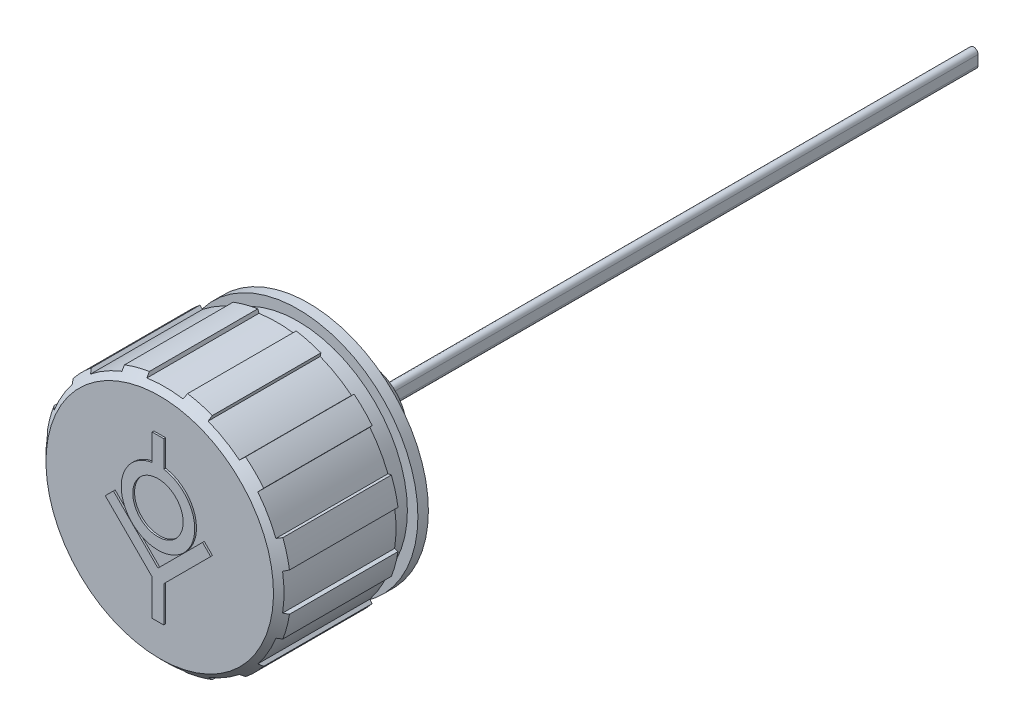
ISO-10303-21;
HEADER;
FILE_DESCRIPTION(('STEP AP214'),'2;1');
FILE_NAME('part.step','',(''),(''),'','','');
FILE_SCHEMA(('AUTOMOTIVE_DESIGN { 1 0 10303 214 1 1 1 1 }'));
ENDSEC;
DATA;
#1=APPLICATION_CONTEXT('core data for automotive mechanical design processes');
#2=APPLICATION_PROTOCOL_DEFINITION('international standard','automotive_design',2000,#1);
#3=PRODUCT_CONTEXT('',#1,'mechanical');
#4=PRODUCT('Part','Part','',(#3));
#5=PRODUCT_RELATED_PRODUCT_CATEGORY('part','',(#4));
#6=PRODUCT_DEFINITION_FORMATION('','',#4);
#7=PRODUCT_DEFINITION_CONTEXT('part definition',#1,'design');
#8=PRODUCT_DEFINITION('design','',#6,#7);
#9=PRODUCT_DEFINITION_SHAPE('','',#8);
#10=(LENGTH_UNIT() NAMED_UNIT(*) SI_UNIT(.MILLI.,.METRE.));
#11=(NAMED_UNIT(*) PLANE_ANGLE_UNIT() SI_UNIT($,.RADIAN.));
#12=(NAMED_UNIT(*) SI_UNIT($,.STERADIAN.) SOLID_ANGLE_UNIT());
#13=UNCERTAINTY_MEASURE_WITH_UNIT(LENGTH_MEASURE(1.E-05),#10,'distance_accuracy_value','');
#14=(GEOMETRIC_REPRESENTATION_CONTEXT(3) GLOBAL_UNCERTAINTY_ASSIGNED_CONTEXT((#13)) GLOBAL_UNIT_ASSIGNED_CONTEXT((#10,
#11,#12)) REPRESENTATION_CONTEXT('',''));
#15=CARTESIAN_POINT('',(0.,0.,0.));
#16=DIRECTION('',(0.,0.,1.));
#17=DIRECTION('',(1.,0.,0.));
#18=AXIS2_PLACEMENT_3D('',#15,#16,#17);
#19=CARTESIAN_POINT('',(-2.04251658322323E-13,32.5,42.5));
#20=DIRECTION('',(0.,0.,-1.));
#21=DIRECTION('',(-1.,0.,0.));
#22=AXIS2_PLACEMENT_3D('',#19,#20,#21);
#23=PLANE('',#22);
#24=CARTESIAN_POINT('',(-2.03351658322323E-13,5.1,42.5));
#25=DIRECTION('',(0.,0.,1.));
#26=DIRECTION('',(1.,0.,0.));
#27=AXIS2_PLACEMENT_3D('',#24,#25,#26);
#28=CIRCLE('',#27,7.2);
#29=CARTESIAN_POINT('',(7.1999999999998,5.1,42.5));
#30=VERTEX_POINT('',#29);
#31=EDGE_CURVE('E1155',#30,#30,#28,.T.);
#32=ORIENTED_EDGE('',*,*,#31,.T.);
#33=EDGE_LOOP('',(#32));
#34=FACE_BOUND('',#33,.T.);
#35=ADVANCED_FACE('F15',(#34),#23,.F.);
#36=CARTESIAN_POINT('',(-2.03348166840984E-13,5.1,42.499));
#37=DIRECTION('',(0.,0.,1.));
#38=DIRECTION('',(1.,0.,0.));
#39=AXIS2_PLACEMENT_3D('',#36,#37,#38);
#40=CYLINDRICAL_SURFACE('',#39,7.2);
#41=ORIENTED_EDGE('',*,*,#31,.F.);
#42=EDGE_LOOP('',(#41));
#43=FACE_BOUND('',#42,.T.);
#44=CARTESIAN_POINT('',(-2.05097398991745E-13,5.1,43.));
#45=DIRECTION('',(0.,0.,1.));
#46=DIRECTION('',(1.,0.,0.));
#47=AXIS2_PLACEMENT_3D('',#44,#45,#46);
#48=CIRCLE('',#47,7.2);
#49=CARTESIAN_POINT('',(7.1999999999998,5.1,43.));
#50=VERTEX_POINT('',#49);
#51=EDGE_CURVE('E1159',#50,#50,#48,.F.);
#52=ORIENTED_EDGE('',*,*,#51,.F.);
#53=EDGE_LOOP('',(#52));
#54=FACE_BOUND('',#53,.T.);
#55=ADVANCED_FACE('F993',(#43,#54),#40,.F.);
#56=CARTESIAN_POINT('',(-2.16622580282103E-13,5.1,43.));
#57=DIRECTION('',(0.,0.,1.));
#58=DIRECTION('',(1.,0.,0.));
#59=AXIS2_PLACEMENT_3D('',#56,#57,#58);
#60=PLANE('',#59);
#61=DIRECTION('',(0.,1.,0.));
#62=VECTOR('',#61,1.);
#63=CARTESIAN_POINT('',(1.6499999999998,15.4695467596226,43.));
#64=LINE('',#63,#62);
#65=CARTESIAN_POINT('',(1.6499999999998,23.,43.));
#66=VERTEX_POINT('',#65);
#67=CARTESIAN_POINT('',(1.6499999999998,15.4695467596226,43.));
#68=VERTEX_POINT('',#67);
#69=EDGE_CURVE('E358',#66,#68,#64,.F.);
#70=ORIENTED_EDGE('',*,*,#69,.F.);
#71=DIRECTION('',(-1.,0.,0.));
#72=VECTOR('',#71,1.);
#73=CARTESIAN_POINT('',(1.6499999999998,23.,43.));
#74=LINE('',#73,#72);
#75=CARTESIAN_POINT('',(-1.6500000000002,23.,43.));
#76=VERTEX_POINT('',#75);
#77=EDGE_CURVE('E365',#76,#66,#74,.F.);
#78=ORIENTED_EDGE('',*,*,#77,.F.);
#79=DIRECTION('',(0.,1.,0.));
#80=VECTOR('',#79,1.);
#81=CARTESIAN_POINT('',(-1.6500000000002,23.,43.));
#82=LINE('',#81,#80);
#83=CARTESIAN_POINT('',(-1.6500000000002,15.4695467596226,43.));
#84=VERTEX_POINT('',#83);
#85=EDGE_CURVE('E538',#84,#76,#82,.T.);
#86=ORIENTED_EDGE('',*,*,#85,.F.);
#87=CARTESIAN_POINT('',(-2.16622580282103E-13,5.1,43.));
#88=DIRECTION('',(0.,0.,1.));
#89=DIRECTION('',(1.,0.,0.));
#90=AXIS2_PLACEMENT_3D('',#87,#88,#89);
#91=CIRCLE('',#90,10.5);
#92=EDGE_CURVE('E561',#68,#84,#91,.F.);
#93=ORIENTED_EDGE('',*,*,#92,.F.);
#94=EDGE_LOOP('',(#70,#78,#86,#93));
#95=FACE_BOUND('',#94,.T.);
#96=ORIENTED_EDGE('',*,*,#51,.T.);
#97=EDGE_LOOP('',(#96));
#98=FACE_BOUND('',#97,.T.);
#99=ADVANCED_FACE('F990',(#95,#98),#60,.T.);
#100=CARTESIAN_POINT('',(-2.05997398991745E-13,0.,43.));
#101=DIRECTION('',(0.,0.,-1.));
#102=DIRECTION('',(-1.,0.,0.));
#103=AXIS2_PLACEMENT_3D('',#100,#101,#102);
#104=PLANE('',#103);
#105=DIRECTION('',(0.7071087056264,-0.707104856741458,0.));
#106=VECTOR('',#105,1.);
#107=CARTESIAN_POINT('',(-15.0614,0.545227,43.));
#108=LINE('',#107,#106);
#109=CARTESIAN_POINT('',(-1.6500000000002,-12.8661,43.));
#110=VERTEX_POINT('',#109);
#111=CARTESIAN_POINT('',(-15.0614,0.545227,43.));
#112=VERTEX_POINT('',#111);
#113=EDGE_CURVE('E435',#110,#112,#108,.F.);
#114=ORIENTED_EDGE('',*,*,#113,.F.);
#115=DIRECTION('',(0.,-1.,0.));
#116=VECTOR('',#115,1.);
#117=CARTESIAN_POINT('',(-1.6500000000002,-12.8661,43.));
#118=LINE('',#117,#116);
#119=CARTESIAN_POINT('',(-1.6500000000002,-23.1,43.));
#120=VERTEX_POINT('',#119);
#121=EDGE_CURVE('E532',#120,#110,#118,.F.);
#122=ORIENTED_EDGE('',*,*,#121,.F.);
#123=DIRECTION('',(1.,0.,0.));
#124=VECTOR('',#123,1.);
#125=CARTESIAN_POINT('',(-1.6500000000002,-23.1,43.));
#126=LINE('',#125,#124);
#127=CARTESIAN_POINT('',(1.6499999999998,-23.1,43.));
#128=VERTEX_POINT('',#127);
#129=EDGE_CURVE('E530',#128,#120,#126,.F.);
#130=ORIENTED_EDGE('',*,*,#129,.F.);
#131=DIRECTION('',(0.,1.,0.));
#132=VECTOR('',#131,1.);
#133=CARTESIAN_POINT('',(1.6499999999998,-23.1,43.));
#134=LINE('',#133,#132);
#135=CARTESIAN_POINT('',(1.6499999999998,-12.8661,43.));
#136=VERTEX_POINT('',#135);
#137=EDGE_CURVE('E526',#136,#128,#134,.F.);
#138=ORIENTED_EDGE('',*,*,#137,.F.);
#139=DIRECTION('',(0.7071087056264,0.707104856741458,0.));
#140=VECTOR('',#139,1.);
#141=CARTESIAN_POINT('',(1.6499999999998,-12.8661,43.));
#142=LINE('',#141,#140);
#143=CARTESIAN_POINT('',(15.0614,0.545227,43.));
#144=VERTEX_POINT('',#143);
#145=EDGE_CURVE('E522',#144,#136,#142,.F.);
#146=ORIENTED_EDGE('',*,*,#145,.F.);
#147=DIRECTION('',(-0.707113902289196,0.707099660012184,0.));
#148=VECTOR('',#147,1.);
#149=CARTESIAN_POINT('',(15.0614,0.545227,43.));
#150=LINE('',#149,#148);
#151=CARTESIAN_POINT('',(12.7278999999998,2.87868,43.));
#152=VERTEX_POINT('',#151);
#153=EDGE_CURVE('E518',#152,#144,#150,.F.);
#154=ORIENTED_EDGE('',*,*,#153,.F.);
#155=DIRECTION('',(-0.707106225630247,-0.707107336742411,0.));
#156=VECTOR('',#155,1.);
#157=CARTESIAN_POINT('',(12.7278999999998,2.87868,43.));
#158=LINE('',#157,#156);
#159=CARTESIAN_POINT('',(-2.07388212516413E-13,-9.84924,43.));
#160=VERTEX_POINT('',#159);
#161=EDGE_CURVE('E514',#160,#152,#158,.F.);
#162=ORIENTED_EDGE('',*,*,#161,.F.);
#163=DIRECTION('',(-0.707106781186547,0.707106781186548,0.));
#164=VECTOR('',#163,1.);
#165=CARTESIAN_POINT('',(-2.07773755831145E-13,-9.84924,43.));
#166=LINE('',#165,#164);
#167=CARTESIAN_POINT('',(-12.7279100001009,2.87867000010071,43.));
#168=VERTEX_POINT('',#167);
#169=EDGE_CURVE('E510',#168,#160,#166,.F.);
#170=ORIENTED_EDGE('',*,*,#169,.F.);
#171=DIRECTION('',(-0.707113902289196,-0.707099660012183,0.));
#172=VECTOR('',#171,1.);
#173=CARTESIAN_POINT('',(-12.7279100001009,2.87867000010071,43.));
#174=LINE('',#173,#172);
#175=EDGE_CURVE('E506',#112,#168,#174,.F.);
#176=ORIENTED_EDGE('',*,*,#175,.F.);
#177=EDGE_LOOP('',(#114,#122,#130,#138,#146,#154,#162,#170,#176));
#178=FACE_BOUND('',#177,.T.);
#179=ADVANCED_FACE('F982',(#178),#104,.F.);
#180=CARTESIAN_POINT('',(-2.14873348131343E-13,5.1,42.499));
#181=DIRECTION('',(0.,0.,1.));
#182=DIRECTION('',(1.,0.,0.));
#183=AXIS2_PLACEMENT_3D('',#180,#181,#182);
#184=CYLINDRICAL_SURFACE('',#183,10.5);
#185=ORIENTED_EDGE('',*,*,#92,.T.);
#186=DIRECTION('',(0.,0.,1.));
#187=VECTOR('',#186,1.);
#188=CARTESIAN_POINT('',(-1.6500000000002,15.4695467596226,42.499));
#189=LINE('',#188,#187);
#190=CARTESIAN_POINT('',(-1.6500000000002,15.4695467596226,42.5));
#191=VERTEX_POINT('',#190);
#192=EDGE_CURVE('E535',#191,#84,#189,.T.);
#193=ORIENTED_EDGE('',*,*,#192,.F.);
#194=CARTESIAN_POINT('',(-2.14876839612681E-13,5.1,42.5));
#195=DIRECTION('',(0.,0.,1.));
#196=DIRECTION('',(1.,0.,0.));
#197=AXIS2_PLACEMENT_3D('',#194,#195,#196);
#198=CIRCLE('',#197,10.5);
#199=CARTESIAN_POINT('',(1.64999999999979,15.4695467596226,42.5));
#200=VERTEX_POINT('',#199);
#201=EDGE_CURVE('E487',#191,#200,#198,.T.);
#202=ORIENTED_EDGE('',*,*,#201,.T.);
#203=DIRECTION('',(0.,0.,-1.));
#204=VECTOR('',#203,1.);
#205=CARTESIAN_POINT('',(1.6499999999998,15.4695467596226,42.499));
#206=LINE('',#205,#204);
#207=EDGE_CURVE('E550',#68,#200,#206,.T.);
#208=ORIENTED_EDGE('',*,*,#207,.F.);
#209=EDGE_LOOP('',(#185,#193,#202,#208));
#210=FACE_BOUND('',#209,.T.);
#211=ADVANCED_FACE('F979',(#210),#184,.T.);
#212=CARTESIAN_POINT('',(1.6499999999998,15.4695467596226,42.499));
#213=DIRECTION('',(1.,0.,0.));
#214=DIRECTION('',(0.,0.,-1.));
#215=AXIS2_PLACEMENT_3D('',#212,#213,#214);
#216=PLANE('',#215);
#217=ORIENTED_EDGE('',*,*,#69,.T.);
#218=ORIENTED_EDGE('',*,*,#207,.T.);
#219=DIRECTION('',(0.,1.,0.));
#220=VECTOR('',#219,1.);
#221=CARTESIAN_POINT('',(1.64999999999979,32.5,42.5));
#222=LINE('',#221,#220);
#223=CARTESIAN_POINT('',(1.64999999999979,23.,42.5));
#224=VERTEX_POINT('',#223);
#225=EDGE_CURVE('E484',#200,#224,#222,.T.);
#226=ORIENTED_EDGE('',*,*,#225,.T.);
#227=DIRECTION('',(0.,0.,1.));
#228=VECTOR('',#227,1.);
#229=CARTESIAN_POINT('',(1.6499999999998,23.,42.499));
#230=LINE('',#229,#228);
#231=EDGE_CURVE('E539',#66,#224,#230,.F.);
#232=ORIENTED_EDGE('',*,*,#231,.F.);
#233=EDGE_LOOP('',(#217,#218,#226,#232));
#234=FACE_BOUND('',#233,.T.);
#235=ADVANCED_FACE('F976',(#234),#216,.T.);
#236=CARTESIAN_POINT('',(1.6499999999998,23.,42.499));
#237=DIRECTION('',(0.,1.,0.));
#238=DIRECTION('',(-1.,0.,0.));
#239=AXIS2_PLACEMENT_3D('',#236,#237,#238);
#240=PLANE('',#239);
#241=ORIENTED_EDGE('',*,*,#77,.T.);
#242=ORIENTED_EDGE('',*,*,#231,.T.);
#243=DIRECTION('',(-1.,0.,0.));
#244=VECTOR('',#243,1.);
#245=CARTESIAN_POINT('',(-2.04251658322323E-13,23.,42.5));
#246=LINE('',#245,#244);
#247=CARTESIAN_POINT('',(-1.6500000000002,23.,42.5));
#248=VERTEX_POINT('',#247);
#249=EDGE_CURVE('E481',#224,#248,#246,.T.);
#250=ORIENTED_EDGE('',*,*,#249,.T.);
#251=DIRECTION('',(0.,0.,1.));
#252=VECTOR('',#251,1.);
#253=CARTESIAN_POINT('',(-1.6500000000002,23.,42.499));
#254=LINE('',#253,#252);
#255=EDGE_CURVE('E534',#76,#248,#254,.F.);
#256=ORIENTED_EDGE('',*,*,#255,.F.);
#257=EDGE_LOOP('',(#241,#242,#250,#256));
#258=FACE_BOUND('',#257,.T.);
#259=ADVANCED_FACE('F972',(#258),#240,.T.);
#260=CARTESIAN_POINT('',(-1.6500000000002,23.,42.499));
#261=DIRECTION('',(-1.,0.,0.));
#262=DIRECTION('',(0.,0.,1.));
#263=AXIS2_PLACEMENT_3D('',#260,#261,#262);
#264=PLANE('',#263);
#265=ORIENTED_EDGE('',*,*,#85,.T.);
#266=ORIENTED_EDGE('',*,*,#255,.T.);
#267=DIRECTION('',(0.,1.,0.));
#268=VECTOR('',#267,1.);
#269=CARTESIAN_POINT('',(-1.6500000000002,32.5,42.5));
#270=LINE('',#269,#268);
#271=EDGE_CURVE('E478',#248,#191,#270,.F.);
#272=ORIENTED_EDGE('',*,*,#271,.T.);
#273=ORIENTED_EDGE('',*,*,#192,.T.);
#274=EDGE_LOOP('',(#265,#266,#272,#273));
#275=FACE_BOUND('',#274,.T.);
#276=ADVANCED_FACE('F968',(#275),#264,.T.);
#277=CARTESIAN_POINT('',(-1.6500000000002,-12.8661,42.499));
#278=DIRECTION('',(-1.,0.,0.));
#279=DIRECTION('',(0.,-1.,0.));
#280=AXIS2_PLACEMENT_3D('',#277,#278,#279);
#281=PLANE('',#280);
#282=ORIENTED_EDGE('',*,*,#121,.T.);
#283=DIRECTION('',(0.,0.,1.));
#284=VECTOR('',#283,1.);
#285=CARTESIAN_POINT('',(-1.6500000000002,-12.8661,42.499));
#286=LINE('',#285,#284);
#287=CARTESIAN_POINT('',(-1.6500000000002,-12.8661,42.5));
#288=VERTEX_POINT('',#287);
#289=EDGE_CURVE('E503',#288,#110,#286,.T.);
#290=ORIENTED_EDGE('',*,*,#289,.F.);
#291=DIRECTION('',(0.,1.,0.));
#292=VECTOR('',#291,1.);
#293=CARTESIAN_POINT('',(-1.6500000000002,32.5,42.5));
#294=LINE('',#293,#292);
#295=CARTESIAN_POINT('',(-1.6500000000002,-23.1,42.5));
#296=VERTEX_POINT('',#295);
#297=EDGE_CURVE('E450',#288,#296,#294,.F.);
#298=ORIENTED_EDGE('',*,*,#297,.T.);
#299=DIRECTION('',(0.,0.,1.));
#300=VECTOR('',#299,1.);
#301=CARTESIAN_POINT('',(-1.6500000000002,-23.1,42.499));
#302=LINE('',#301,#300);
#303=EDGE_CURVE('E528',#120,#296,#302,.F.);
#304=ORIENTED_EDGE('',*,*,#303,.F.);
#305=EDGE_LOOP('',(#282,#290,#298,#304));
#306=FACE_BOUND('',#305,.T.);
#307=ADVANCED_FACE('F964',(#306),#281,.T.);
#308=CARTESIAN_POINT('',(-1.6500000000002,-23.1,42.499));
#309=DIRECTION('',(0.,-1.,0.));
#310=DIRECTION('',(1.,0.,0.));
#311=AXIS2_PLACEMENT_3D('',#308,#309,#310);
#312=PLANE('',#311);
#313=ORIENTED_EDGE('',*,*,#129,.T.);
#314=ORIENTED_EDGE('',*,*,#303,.T.);
#315=DIRECTION('',(-1.,0.,0.));
#316=VECTOR('',#315,1.);
#317=CARTESIAN_POINT('',(-2.04251658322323E-13,-23.1,42.5));
#318=LINE('',#317,#316);
#319=CARTESIAN_POINT('',(1.6499999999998,-23.1,42.5));
#320=VERTEX_POINT('',#319);
#321=EDGE_CURVE('E474',#296,#320,#318,.F.);
#322=ORIENTED_EDGE('',*,*,#321,.T.);
#323=DIRECTION('',(0.,0.,-1.));
#324=VECTOR('',#323,1.);
#325=CARTESIAN_POINT('',(1.6499999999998,-23.1,42.499));
#326=LINE('',#325,#324);
#327=EDGE_CURVE('E524',#128,#320,#326,.T.);
#328=ORIENTED_EDGE('',*,*,#327,.F.);
#329=EDGE_LOOP('',(#313,#314,#322,#328));
#330=FACE_BOUND('',#329,.T.);
#331=ADVANCED_FACE('F960',(#330),#312,.T.);
#332=CARTESIAN_POINT('',(1.6499999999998,-23.1,42.499));
#333=DIRECTION('',(1.,0.,0.));
#334=DIRECTION('',(0.,0.,-1.));
#335=AXIS2_PLACEMENT_3D('',#332,#333,#334);
#336=PLANE('',#335);
#337=ORIENTED_EDGE('',*,*,#137,.T.);
#338=ORIENTED_EDGE('',*,*,#327,.T.);
#339=DIRECTION('',(0.,1.,0.));
#340=VECTOR('',#339,1.);
#341=CARTESIAN_POINT('',(1.6499999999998,32.5,42.5));
#342=LINE('',#341,#340);
#343=CARTESIAN_POINT('',(1.6499999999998,-12.8661,42.5));
#344=VERTEX_POINT('',#343);
#345=EDGE_CURVE('E471',#320,#344,#342,.T.);
#346=ORIENTED_EDGE('',*,*,#345,.T.);
#347=DIRECTION('',(0.,0.,1.));
#348=VECTOR('',#347,1.);
#349=CARTESIAN_POINT('',(1.6499999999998,-12.8661,42.499));
#350=LINE('',#349,#348);
#351=EDGE_CURVE('E520',#136,#344,#350,.F.);
#352=ORIENTED_EDGE('',*,*,#351,.F.);
#353=EDGE_LOOP('',(#337,#338,#346,#352));
#354=FACE_BOUND('',#353,.T.);
#355=ADVANCED_FACE('F956',(#354),#336,.T.);
#356=CARTESIAN_POINT('',(1.6499999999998,-12.8661,42.499));
#357=DIRECTION('',(0.707104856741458,-0.7071087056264,0.));
#358=DIRECTION('',(0.7071087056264,0.707104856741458,0.));
#359=AXIS2_PLACEMENT_3D('',#356,#357,#358);
#360=PLANE('',#359);
#361=ORIENTED_EDGE('',*,*,#145,.T.);
#362=ORIENTED_EDGE('',*,*,#351,.T.);
#363=DIRECTION('',(0.7071087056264,0.707104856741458,0.));
#364=VECTOR('',#363,1.);
#365=CARTESIAN_POINT('',(1.6499999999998,-12.8661,42.5));
#366=LINE('',#365,#364);
#367=CARTESIAN_POINT('',(15.0614,0.545227,42.5));
#368=VERTEX_POINT('',#367);
#369=EDGE_CURVE('E468',#344,#368,#366,.T.);
#370=ORIENTED_EDGE('',*,*,#369,.T.);
#371=DIRECTION('',(0.,0.,1.));
#372=VECTOR('',#371,1.);
#373=CARTESIAN_POINT('',(15.0614,0.545227,42.499));
#374=LINE('',#373,#372);
#375=EDGE_CURVE('E516',#144,#368,#374,.F.);
#376=ORIENTED_EDGE('',*,*,#375,.F.);
#377=EDGE_LOOP('',(#361,#362,#370,#376));
#378=FACE_BOUND('',#377,.T.);
#379=ADVANCED_FACE('F952',(#378),#360,.T.);
#380=CARTESIAN_POINT('',(15.0614,0.545227,42.499));
#381=DIRECTION('',(0.707099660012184,0.707113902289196,0.));
#382=DIRECTION('',(-0.707113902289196,0.707099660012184,0.));
#383=AXIS2_PLACEMENT_3D('',#380,#381,#382);
#384=PLANE('',#383);
#385=ORIENTED_EDGE('',*,*,#153,.T.);
#386=ORIENTED_EDGE('',*,*,#375,.T.);
#387=DIRECTION('',(-0.707113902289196,0.707099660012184,0.));
#388=VECTOR('',#387,1.);
#389=CARTESIAN_POINT('',(15.0614,0.545227,42.5));
#390=LINE('',#389,#388);
#391=CARTESIAN_POINT('',(12.7278999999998,2.87868,42.5));
#392=VERTEX_POINT('',#391);
#393=EDGE_CURVE('E465',#368,#392,#390,.T.);
#394=ORIENTED_EDGE('',*,*,#393,.T.);
#395=DIRECTION('',(0.,0.,1.));
#396=VECTOR('',#395,1.);
#397=CARTESIAN_POINT('',(12.7278999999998,2.87868,42.499));
#398=LINE('',#397,#396);
#399=EDGE_CURVE('E512',#152,#392,#398,.F.);
#400=ORIENTED_EDGE('',*,*,#399,.F.);
#401=EDGE_LOOP('',(#385,#386,#394,#400));
#402=FACE_BOUND('',#401,.T.);
#403=ADVANCED_FACE('F948',(#402),#384,.T.);
#404=CARTESIAN_POINT('',(12.7278999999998,2.87868,42.499));
#405=DIRECTION('',(-0.707107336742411,0.707106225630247,0.));
#406=DIRECTION('',(-0.707106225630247,-0.707107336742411,0.));
#407=AXIS2_PLACEMENT_3D('',#404,#405,#406);
#408=PLANE('',#407);
#409=ORIENTED_EDGE('',*,*,#161,.T.);
#410=ORIENTED_EDGE('',*,*,#399,.T.);
#411=DIRECTION('',(-0.707106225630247,-0.707107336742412,0.));
#412=VECTOR('',#411,1.);
#413=CARTESIAN_POINT('',(12.7278999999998,2.87868,42.5));
#414=LINE('',#413,#412);
#415=CARTESIAN_POINT('',(-2.03474068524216E-13,-9.84924,42.5));
#416=VERTEX_POINT('',#415);
#417=EDGE_CURVE('E459',#392,#416,#414,.T.);
#418=ORIENTED_EDGE('',*,*,#417,.T.);
#419=DIRECTION('',(0.,0.,1.));
#420=VECTOR('',#419,1.);
#421=CARTESIAN_POINT('',(-2.04713072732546E-13,-9.84924,42.499));
#422=LINE('',#421,#420);
#423=EDGE_CURVE('E508',#160,#416,#422,.F.);
#424=ORIENTED_EDGE('',*,*,#423,.F.);
#425=EDGE_LOOP('',(#409,#410,#418,#424));
#426=FACE_BOUND('',#425,.T.);
#427=ADVANCED_FACE('F944',(#426),#408,.T.);
#428=CARTESIAN_POINT('',(-2.06024523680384E-13,-9.84924,42.499));
#429=DIRECTION('',(0.707106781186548,0.707106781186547,0.));
#430=DIRECTION('',(-0.707106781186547,0.707106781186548,0.));
#431=AXIS2_PLACEMENT_3D('',#428,#429,#430);
#432=PLANE('',#431);
#433=ORIENTED_EDGE('',*,*,#169,.T.);
#434=ORIENTED_EDGE('',*,*,#423,.T.);
#435=DIRECTION('',(-0.707106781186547,0.707106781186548,0.));
#436=VECTOR('',#435,1.);
#437=CARTESIAN_POINT('',(-2.00782211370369E-13,-9.84924,42.5));
#438=LINE('',#437,#436);
#439=CARTESIAN_POINT('',(-12.7279100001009,2.87867000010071,42.5));
#440=VERTEX_POINT('',#439);
#441=EDGE_CURVE('E457',#416,#440,#438,.T.);
#442=ORIENTED_EDGE('',*,*,#441,.T.);
#443=DIRECTION('',(0.,0.,1.));
#444=VECTOR('',#443,1.);
#445=CARTESIAN_POINT('',(-12.7279100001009,2.87867000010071,42.499));
#446=LINE('',#445,#444);
#447=EDGE_CURVE('E456',#168,#440,#446,.F.);
#448=ORIENTED_EDGE('',*,*,#447,.F.);
#449=EDGE_LOOP('',(#433,#434,#442,#448));
#450=FACE_BOUND('',#449,.T.);
#451=ADVANCED_FACE('F941',(#450),#432,.T.);
#452=CARTESIAN_POINT('',(-12.7279100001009,2.87867000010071,42.499));
#453=DIRECTION('',(-0.707099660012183,0.707113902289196,0.));
#454=DIRECTION('',(-0.707113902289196,-0.707099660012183,0.));
#455=AXIS2_PLACEMENT_3D('',#452,#453,#454);
#456=PLANE('',#455);
#457=ORIENTED_EDGE('',*,*,#175,.T.);
#458=ORIENTED_EDGE('',*,*,#447,.T.);
#459=DIRECTION('',(-0.707113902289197,-0.707099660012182,0.));
#460=VECTOR('',#459,1.);
#461=CARTESIAN_POINT('',(-12.7279100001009,2.87867000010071,42.5));
#462=LINE('',#461,#460);
#463=CARTESIAN_POINT('',(-15.0614,0.545227,42.5));
#464=VERTEX_POINT('',#463);
#465=EDGE_CURVE('E446',#440,#464,#462,.T.);
#466=ORIENTED_EDGE('',*,*,#465,.T.);
#467=DIRECTION('',(0.,0.,1.));
#468=VECTOR('',#467,1.);
#469=CARTESIAN_POINT('',(-15.0614,0.545227,42.499));
#470=LINE('',#469,#468);
#471=EDGE_CURVE('E429',#112,#464,#470,.F.);
#472=ORIENTED_EDGE('',*,*,#471,.F.);
#473=EDGE_LOOP('',(#457,#458,#466,#472));
#474=FACE_BOUND('',#473,.T.);
#475=ADVANCED_FACE('F454',(#474),#456,.T.);
#476=CARTESIAN_POINT('',(-15.0614,0.545227,42.499));
#477=DIRECTION('',(-0.707104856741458,-0.7071087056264,0.));
#478=DIRECTION('',(0.7071087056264,-0.707104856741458,0.));
#479=AXIS2_PLACEMENT_3D('',#476,#477,#478);
#480=PLANE('',#479);
#481=ORIENTED_EDGE('',*,*,#113,.T.);
#482=ORIENTED_EDGE('',*,*,#471,.T.);
#483=DIRECTION('',(0.7071087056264,-0.707104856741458,0.));
#484=VECTOR('',#483,1.);
#485=CARTESIAN_POINT('',(-15.0614,0.545227,42.5));
#486=LINE('',#485,#484);
#487=EDGE_CURVE('E433',#464,#288,#486,.T.);
#488=ORIENTED_EDGE('',*,*,#487,.T.);
#489=ORIENTED_EDGE('',*,*,#289,.T.);
#490=EDGE_LOOP('',(#481,#482,#488,#489));
#491=FACE_BOUND('',#490,.T.);
#492=ADVANCED_FACE('F431',(#491),#480,.T.);
#493=CARTESIAN_POINT('',(-2.04251658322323E-13,32.5,42.5));
#494=DIRECTION('',(0.,0.,-1.));
#495=DIRECTION('',(-1.,0.,0.));
#496=AXIS2_PLACEMENT_3D('',#493,#494,#495);
#497=PLANE('',#496);
#498=CARTESIAN_POINT('',(-2.04251658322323E-13,0.,42.5));
#499=DIRECTION('',(0.,0.,-1.));
#500=DIRECTION('',(0.,-1.,0.));
#501=AXIS2_PLACEMENT_3D('',#498,#499,#500);
#502=CIRCLE('',#501,32.5);
#503=CARTESIAN_POINT('',(-2.04251658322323E-13,-32.5,42.5));
#504=VERTEX_POINT('',#503);
#505=EDGE_CURVE('E1313',#504,#504,#502,.T.);
#506=ORIENTED_EDGE('',*,*,#505,.F.);
#507=EDGE_LOOP('',(#506));
#508=FACE_BOUND('',#507,.T.);
#509=ORIENTED_EDGE('',*,*,#465,.F.);
#510=ORIENTED_EDGE('',*,*,#441,.F.);
#511=ORIENTED_EDGE('',*,*,#417,.F.);
#512=ORIENTED_EDGE('',*,*,#393,.F.);
#513=ORIENTED_EDGE('',*,*,#369,.F.);
#514=ORIENTED_EDGE('',*,*,#345,.F.);
#515=ORIENTED_EDGE('',*,*,#321,.F.);
#516=ORIENTED_EDGE('',*,*,#297,.F.);
#517=ORIENTED_EDGE('',*,*,#487,.F.);
#518=EDGE_LOOP('',(#509,#510,#511,#512,#513,#514,#515,#516,#517));
#519=FACE_BOUND('',#518,.T.);
#520=ORIENTED_EDGE('',*,*,#249,.F.);
#521=ORIENTED_EDGE('',*,*,#225,.F.);
#522=ORIENTED_EDGE('',*,*,#201,.F.);
#523=ORIENTED_EDGE('',*,*,#271,.F.);
#524=EDGE_LOOP('',(#520,#521,#522,#523));
#525=FACE_BOUND('',#524,.T.);
#526=ADVANCED_FACE('F443',(#508,#519,#525),#497,.F.);
#527=CARTESIAN_POINT('',(-12.5428782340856,32.6753149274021,8.));
#528=DIRECTION('',(-0.978147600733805,-0.20791169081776,0.));
#529=DIRECTION('',(0.20791169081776,-0.978147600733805,0.));
#530=AXIS2_PLACEMENT_3D('',#527,#528,#529);
#531=PLANE('',#530);
#532=CARTESIAN_POINT('',(-12.5428782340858,32.6753149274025,39.9999999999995));
#533=CARTESIAN_POINT('',(-12.507787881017,32.5102277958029,40.1666982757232));
#534=CARTESIAN_POINT('',(-12.472694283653,32.3451254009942,40.3333807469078));
#535=CARTESIAN_POINT('',(-12.4025006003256,32.014890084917,40.6667140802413));
#536=CARTESIAN_POINT('',(-12.3674005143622,31.8497571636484,40.8333649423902));
#537=CARTESIAN_POINT('',(-12.3322971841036,31.6846089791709,41.));
#538=B_SPLINE_CURVE_WITH_KNOTS('',3,(#532,#533,#534,#535,#536,#537),.UNSPECIFIED.,.F.,.F.,(4,2,
4),(0.,0.711660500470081,1.42332100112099),.UNSPECIFIED.);
#539=CARTESIAN_POINT('',(-12.5428782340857,32.6753149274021,39.9999999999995));
#540=VERTEX_POINT('',#539);
#541=CARTESIAN_POINT('',(-12.3322971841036,31.6846089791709,41.));
#542=VERTEX_POINT('',#541);
#543=EDGE_CURVE('E741',#540,#542,#538,.T.);
#544=ORIENTED_EDGE('',*,*,#543,.F.);
#545=DIRECTION('',(0.,0.,1.));
#546=VECTOR('',#545,1.);
#547=CARTESIAN_POINT('',(-12.5428782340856,32.6753149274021,8.));
#548=LINE('',#547,#546);
#549=CARTESIAN_POINT('',(-12.5428782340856,32.6753149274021,9.));
#550=VERTEX_POINT('',#549);
#551=EDGE_CURVE('E672',#550,#540,#548,.T.);
#552=ORIENTED_EDGE('',*,*,#551,.F.);
#553=DIRECTION('',(0.20791169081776,-0.978147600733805,0.));
#554=VECTOR('',#553,1.);
#555=CARTESIAN_POINT('',(-12.5428782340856,32.6753149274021,9.));
#556=LINE('',#555,#554);
#557=CARTESIAN_POINT('',(-12.3322971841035,31.6846089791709,9.));
#558=VERTEX_POINT('',#557);
#559=EDGE_CURVE('E1396',#550,#558,#556,.T.);
#560=ORIENTED_EDGE('',*,*,#559,.T.);
#561=DIRECTION('',(0.,0.,1.));
#562=VECTOR('',#561,1.);
#563=CARTESIAN_POINT('',(-12.3322971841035,31.6846089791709,8.));
#564=LINE('',#563,#562);
#565=EDGE_CURVE('E1299',#542,#558,#564,.F.);
#566=ORIENTED_EDGE('',*,*,#565,.F.);
#567=EDGE_LOOP('',(#544,#552,#560,#566));
#568=FACE_BOUND('',#567,.T.);
#569=ADVANCED_FACE('F906',(#568),#531,.T.);
#570=CARTESIAN_POINT('',(-21.2735276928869,26.5223871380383,8.));
#571=DIRECTION('',(0.669130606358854,0.743144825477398,0.));
#572=DIRECTION('',(-0.743144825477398,0.669130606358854,0.));
#573=AXIS2_PLACEMENT_3D('',#570,#571,#572);
#574=PLANE('',#573);
#575=CARTESIAN_POINT('',(-21.273527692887,26.5223871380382,41.));
#576=CARTESIAN_POINT('',(-21.3989985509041,26.6353616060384,40.8333649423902));
#577=CARTESIAN_POINT('',(-21.524457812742,26.7483256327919,40.6667140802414));
#578=CARTESIAN_POINT('',(-21.7753531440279,26.9742328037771,40.3333807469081));
#579=CARTESIAN_POINT('',(-21.9007892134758,27.0871759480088,40.1666982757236));
#580=CARTESIAN_POINT('',(-22.0262136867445,27.200108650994,40.));
#581=B_SPLINE_CURVE_WITH_KNOTS('',3,(#575,#576,#577,#578,#579,#580),.UNSPECIFIED.,.F.,.F.,(4,2,
4),(0.,0.711660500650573,1.42332100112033),.UNSPECIFIED.);
#582=CARTESIAN_POINT('',(-21.273527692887,26.5223871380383,41.));
#583=VERTEX_POINT('',#582);
#584=CARTESIAN_POINT('',(-22.0262136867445,27.200108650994,40.));
#585=VERTEX_POINT('',#584);
#586=EDGE_CURVE('E733',#583,#585,#581,.T.);
#587=ORIENTED_EDGE('',*,*,#586,.F.);
#588=DIRECTION('',(0.,0.,1.));
#589=VECTOR('',#588,1.);
#590=CARTESIAN_POINT('',(-21.2735276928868,26.5223871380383,8.));
#591=LINE('',#590,#589);
#592=CARTESIAN_POINT('',(-21.2735276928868,26.5223871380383,9.));
#593=VERTEX_POINT('',#592);
#594=EDGE_CURVE('E1303',#593,#583,#591,.T.);
#595=ORIENTED_EDGE('',*,*,#594,.F.);
#596=DIRECTION('',(-0.743144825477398,0.669130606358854,0.));
#597=VECTOR('',#596,1.);
#598=CARTESIAN_POINT('',(-21.2735276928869,26.5223871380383,9.));
#599=LINE('',#598,#597);
#600=CARTESIAN_POINT('',(-22.0262136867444,27.200108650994,9.));
#601=VERTEX_POINT('',#600);
#602=EDGE_CURVE('E1392',#593,#601,#599,.T.);
#603=ORIENTED_EDGE('',*,*,#602,.T.);
#604=DIRECTION('',(0.,0.,1.));
#605=VECTOR('',#604,1.);
#606=CARTESIAN_POINT('',(-22.0262136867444,27.200108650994,8.));
#607=LINE('',#606,#605);
#608=EDGE_CURVE('E1293',#585,#601,#607,.F.);
#609=ORIENTED_EDGE('',*,*,#608,.F.);
#610=EDGE_LOOP('',(#587,#595,#603,#609));
#611=FACE_BOUND('',#610,.T.);
#612=ADVANCED_FACE('F902',(#611),#574,.T.);
#613=CARTESIAN_POINT('',(-27.2001086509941,22.0262136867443,7.99999999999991));
#614=DIRECTION('',(-0.743144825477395,-0.669130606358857,0.));
#615=DIRECTION('',(0.669130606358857,-0.743144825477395,0.));
#616=AXIS2_PLACEMENT_3D('',#613,#614,#615);
#617=PLANE('',#616);
#618=CARTESIAN_POINT('',(-27.2001086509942,22.0262136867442,40.));
#619=CARTESIAN_POINT('',(-27.087175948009,21.9007892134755,40.1666982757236));
#620=CARTESIAN_POINT('',(-26.9742328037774,21.7753531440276,40.3333807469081));
#621=CARTESIAN_POINT('',(-26.7483256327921,21.5244578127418,40.6667140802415));
#622=CARTESIAN_POINT('',(-26.6353616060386,21.3989985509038,40.8333649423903));
#623=CARTESIAN_POINT('',(-26.5223871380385,21.2735276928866,41.));
#624=B_SPLINE_CURVE_WITH_KNOTS('',3,(#618,#619,#620,#621,#622,#623),.UNSPECIFIED.,.F.,.F.,(4,2,
4),(0.,0.711660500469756,1.42332100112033),.UNSPECIFIED.);
#625=CARTESIAN_POINT('',(-27.2001086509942,22.0262136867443,40.));
#626=VERTEX_POINT('',#625);
#627=CARTESIAN_POINT('',(-26.5223871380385,21.2735276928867,41.));
#628=VERTEX_POINT('',#627);
#629=EDGE_CURVE('E725',#626,#628,#624,.T.);
#630=ORIENTED_EDGE('',*,*,#629,.F.);
#631=DIRECTION('',(0.,0.,1.));
#632=VECTOR('',#631,1.);
#633=CARTESIAN_POINT('',(-27.2001086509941,22.0262136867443,7.99999999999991));
#634=LINE('',#633,#632);
#635=CARTESIAN_POINT('',(-27.2001086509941,22.0262136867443,9.));
#636=VERTEX_POINT('',#635);
#637=EDGE_CURVE('E1297',#636,#626,#634,.T.);
#638=ORIENTED_EDGE('',*,*,#637,.F.);
#639=DIRECTION('',(0.669130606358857,-0.743144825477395,0.));
#640=VECTOR('',#639,1.);
#641=CARTESIAN_POINT('',(-27.2001086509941,22.0262136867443,9.));
#642=LINE('',#641,#640);
#643=CARTESIAN_POINT('',(-26.5223871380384,21.2735276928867,9.));
#644=VERTEX_POINT('',#643);
#645=EDGE_CURVE('E1388',#636,#644,#642,.T.);
#646=ORIENTED_EDGE('',*,*,#645,.T.);
#647=DIRECTION('',(0.,0.,1.));
#648=VECTOR('',#647,1.);
#649=CARTESIAN_POINT('',(-26.5223871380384,21.2735276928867,7.99999999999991));
#650=LINE('',#649,#648);
#651=EDGE_CURVE('E1287',#628,#644,#650,.F.);
#652=ORIENTED_EDGE('',*,*,#651,.F.);
#653=EDGE_LOOP('',(#630,#638,#646,#652));
#654=FACE_BOUND('',#653,.T.);
#655=ADVANCED_FACE('F898',(#654),#617,.T.);
#656=CARTESIAN_POINT('',(-31.684608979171,12.3322971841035,7.99999999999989));
#657=DIRECTION('',(0.207911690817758,0.978147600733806,0.));
#658=DIRECTION('',(-0.978147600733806,0.207911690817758,0.));
#659=AXIS2_PLACEMENT_3D('',#656,#657,#658);
#660=PLANE('',#659);
#661=CARTESIAN_POINT('',(-31.6846089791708,12.3322971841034,41.));
#662=CARTESIAN_POINT('',(-31.8497571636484,12.367400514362,40.8333649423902));
#663=CARTESIAN_POINT('',(-32.0148900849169,12.4025006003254,40.6667140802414));
#664=CARTESIAN_POINT('',(-32.3451254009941,12.4726942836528,40.3333807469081));
#665=CARTESIAN_POINT('',(-32.5102277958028,12.5077878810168,40.1666982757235));
#666=CARTESIAN_POINT('',(-32.6753149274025,12.5428782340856,40.));
#667=B_SPLINE_CURVE_WITH_KNOTS('',3,(#661,#662,#663,#664,#665,#666),.UNSPECIFIED.,.F.,.F.,(4,2,
4),(0.,0.711660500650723,1.42332100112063),.UNSPECIFIED.);
#668=CARTESIAN_POINT('',(-31.684608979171,12.3322971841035,41.));
#669=VERTEX_POINT('',#668);
#670=CARTESIAN_POINT('',(-32.6753149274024,12.5428782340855,39.9999999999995));
#671=VERTEX_POINT('',#670);
#672=EDGE_CURVE('E717',#669,#671,#667,.T.);
#673=ORIENTED_EDGE('',*,*,#672,.F.);
#674=DIRECTION('',(0.,0.,1.));
#675=VECTOR('',#674,1.);
#676=CARTESIAN_POINT('',(-31.6846089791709,12.3322971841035,7.99999999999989));
#677=LINE('',#676,#675);
#678=CARTESIAN_POINT('',(-31.6846089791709,12.3322971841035,8.99999999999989));
#679=VERTEX_POINT('',#678);
#680=EDGE_CURVE('E1291',#679,#669,#677,.T.);
#681=ORIENTED_EDGE('',*,*,#680,.F.);
#682=DIRECTION('',(-0.978147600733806,0.207911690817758,0.));
#683=VECTOR('',#682,1.);
#684=CARTESIAN_POINT('',(-31.684608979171,12.3322971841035,8.99999999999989));
#685=LINE('',#684,#683);
#686=CARTESIAN_POINT('',(-32.6753149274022,12.5428782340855,8.99999999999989));
#687=VERTEX_POINT('',#686);
#688=EDGE_CURVE('E1384',#679,#687,#685,.T.);
#689=ORIENTED_EDGE('',*,*,#688,.T.);
#690=DIRECTION('',(0.,0.,1.));
#691=VECTOR('',#690,1.);
#692=CARTESIAN_POINT('',(-32.6753149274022,12.5428782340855,7.99999999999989));
#693=LINE('',#692,#691);
#694=EDGE_CURVE('E1281',#671,#687,#693,.F.);
#695=ORIENTED_EDGE('',*,*,#694,.F.);
#696=EDGE_LOOP('',(#673,#681,#689,#695));
#697=FACE_BOUND('',#696,.T.);
#698=ADVANCED_FACE('F894',(#697),#660,.T.);
#699=CARTESIAN_POINT('',(-34.5690919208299,5.47520627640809,7.99999999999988));
#700=DIRECTION('',(-0.30901699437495,-0.951056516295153,0.));
#701=DIRECTION('',(0.951056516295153,-0.30901699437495,0.));
#702=AXIS2_PLACEMENT_3D('',#699,#700,#701);
#703=PLANE('',#702);
#704=CARTESIAN_POINT('',(-34.5690919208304,5.47520627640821,39.9999999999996));
#705=CARTESIAN_POINT('',(-34.4085770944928,5.42305184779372,40.1666982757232));
#706=CARTESIAN_POINT('',(-34.2480474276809,5.37089259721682,40.3333807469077));
#707=CARTESIAN_POINT('',(-33.9269584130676,5.26656445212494,40.6667140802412));
#708=CARTESIAN_POINT('',(-33.7663990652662,5.21439555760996,40.8333649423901));
#709=CARTESIAN_POINT('',(-33.6058248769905,5.16222184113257,41.));
#710=B_SPLINE_CURVE_WITH_KNOTS('',3,(#704,#705,#706,#707,#708,#709),.UNSPECIFIED.,.F.,.F.,(4,2,
4),(0.,0.711660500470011,1.42332100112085),.UNSPECIFIED.);
#711=CARTESIAN_POINT('',(-34.5690919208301,5.4752062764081,39.9999999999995));
#712=VERTEX_POINT('',#711);
#713=CARTESIAN_POINT('',(-33.6058248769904,5.16222184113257,41.));
#714=VERTEX_POINT('',#713);
#715=EDGE_CURVE('E684',#712,#714,#710,.T.);
#716=ORIENTED_EDGE('',*,*,#715,.F.);
#717=DIRECTION('',(0.,0.,1.));
#718=VECTOR('',#717,1.);
#719=CARTESIAN_POINT('',(-34.5690919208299,5.4752062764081,7.99999999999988));
#720=LINE('',#719,#718);
#721=CARTESIAN_POINT('',(-34.5690919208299,5.4752062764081,8.99999999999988));
#722=VERTEX_POINT('',#721);
#723=EDGE_CURVE('E1285',#722,#712,#720,.T.);
#724=ORIENTED_EDGE('',*,*,#723,.F.);
#725=DIRECTION('',(0.951056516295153,-0.30901699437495,0.));
#726=VECTOR('',#725,1.);
#727=CARTESIAN_POINT('',(-34.5690919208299,5.47520627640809,8.99999999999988));
#728=LINE('',#727,#726);
#729=CARTESIAN_POINT('',(-33.6058248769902,5.16222184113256,8.99999999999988));
#730=VERTEX_POINT('',#729);
#731=EDGE_CURVE('E1380',#722,#730,#728,.T.);
#732=ORIENTED_EDGE('',*,*,#731,.T.);
#733=DIRECTION('',(0.,0.,1.));
#734=VECTOR('',#733,1.);
#735=CARTESIAN_POINT('',(-33.6058248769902,5.16222184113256,7.99999999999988));
#736=LINE('',#735,#734);
#737=EDGE_CURVE('E1275',#714,#730,#736,.F.);
#738=ORIENTED_EDGE('',*,*,#737,.F.);
#739=EDGE_LOOP('',(#716,#724,#732,#738));
#740=FACE_BOUND('',#739,.T.);
#741=ADVANCED_FACE('F890',(#740),#703,.T.);
#742=CARTESIAN_POINT('',(-33.6058248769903,-5.16222184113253,7.99999999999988));
#743=DIRECTION('',(-0.309016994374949,0.951056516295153,0.));
#744=DIRECTION('',(-0.951056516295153,-0.309016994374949,0.));
#745=AXIS2_PLACEMENT_3D('',#742,#743,#744);
#746=PLANE('',#745);
#747=CARTESIAN_POINT('',(-33.6058248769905,-5.16222184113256,41.));
#748=CARTESIAN_POINT('',(-33.7663990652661,-5.21439555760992,40.8333649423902));
#749=CARTESIAN_POINT('',(-33.9269584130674,-5.26656445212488,40.6667140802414));
#750=CARTESIAN_POINT('',(-34.2480474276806,-5.37089259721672,40.333380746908));
#751=CARTESIAN_POINT('',(-34.4085770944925,-5.42305184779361,40.1666982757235));
#752=CARTESIAN_POINT('',(-34.5690919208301,-5.47520627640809,40.));
#753=B_SPLINE_CURVE_WITH_KNOTS('',3,(#747,#748,#749,#750,#751,#752),.UNSPECIFIED.,.F.,.F.,(4,2,
4),(0.,0.711660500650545,1.42332100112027),.UNSPECIFIED.);
#754=CARTESIAN_POINT('',(-33.6058248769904,-5.16222184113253,41.));
#755=VERTEX_POINT('',#754);
#756=CARTESIAN_POINT('',(-34.5690919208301,-5.47520627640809,40.));
#757=VERTEX_POINT('',#756);
#758=EDGE_CURVE('E705',#755,#757,#753,.T.);
#759=ORIENTED_EDGE('',*,*,#758,.F.);
#760=DIRECTION('',(0.,0.,1.));
#761=VECTOR('',#760,1.);
#762=CARTESIAN_POINT('',(-33.6058248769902,-5.16222184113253,7.99999999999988));
#763=LINE('',#762,#761);
#764=CARTESIAN_POINT('',(-33.6058248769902,-5.16222184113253,8.99999999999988));
#765=VERTEX_POINT('',#764);
#766=EDGE_CURVE('E1279',#765,#755,#763,.T.);
#767=ORIENTED_EDGE('',*,*,#766,.F.);
#768=DIRECTION('',(-0.951056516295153,-0.309016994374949,0.));
#769=VECTOR('',#768,1.);
#770=CARTESIAN_POINT('',(-33.6058248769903,-5.16222184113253,8.99999999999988));
#771=LINE('',#770,#769);
#772=CARTESIAN_POINT('',(-34.5690919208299,-5.47520627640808,8.99999999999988));
#773=VERTEX_POINT('',#772);
#774=EDGE_CURVE('E1376',#765,#773,#771,.T.);
#775=ORIENTED_EDGE('',*,*,#774,.T.);
#776=DIRECTION('',(0.,0.,1.));
#777=VECTOR('',#776,1.);
#778=CARTESIAN_POINT('',(-34.5690919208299,-5.47520627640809,7.99999999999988));
#779=LINE('',#778,#777);
#780=EDGE_CURVE('E1269',#757,#773,#779,.F.);
#781=ORIENTED_EDGE('',*,*,#780,.F.);
#782=EDGE_LOOP('',(#759,#767,#775,#781));
#783=FACE_BOUND('',#782,.T.);
#784=ADVANCED_FACE('F886',(#783),#746,.T.);
#785=CARTESIAN_POINT('',(-32.6753149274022,-12.5428782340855,7.99999999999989));
#786=DIRECTION('',(0.207911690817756,-0.978147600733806,0.));
#787=DIRECTION('',(0.978147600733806,0.207911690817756,0.));
#788=AXIS2_PLACEMENT_3D('',#785,#786,#787);
#789=PLANE('',#788);
#790=CARTESIAN_POINT('',(-32.6753149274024,-12.5428782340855,40.));
#791=CARTESIAN_POINT('',(-32.5102277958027,-12.5077878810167,40.1666982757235));
#792=CARTESIAN_POINT('',(-32.3451254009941,-12.4726942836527,40.333380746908));
#793=CARTESIAN_POINT('',(-32.0148900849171,-12.4025006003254,40.6667140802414));
#794=CARTESIAN_POINT('',(-31.8497571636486,-12.367400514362,40.8333649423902));
#795=CARTESIAN_POINT('',(-31.6846089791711,-12.3322971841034,41.));
#796=B_SPLINE_CURVE_WITH_KNOTS('',3,(#790,#791,#792,#793,#794,#795),.UNSPECIFIED.,.F.,.F.,(4,2,
4),(0.,0.711660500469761,1.42332100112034),.UNSPECIFIED.);
#797=CARTESIAN_POINT('',(-32.6753149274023,-12.5428782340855,40.));
#798=VERTEX_POINT('',#797);
#799=CARTESIAN_POINT('',(-31.6846089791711,-12.3322971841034,41.));
#800=VERTEX_POINT('',#799);
#801=EDGE_CURVE('E871',#798,#800,#796,.T.);
#802=ORIENTED_EDGE('',*,*,#801,.F.);
#803=DIRECTION('',(0.,0.,1.));
#804=VECTOR('',#803,1.);
#805=CARTESIAN_POINT('',(-32.6753149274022,-12.5428782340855,7.99999999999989));
#806=LINE('',#805,#804);
#807=CARTESIAN_POINT('',(-32.6753149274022,-12.5428782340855,8.99999999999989));
#808=VERTEX_POINT('',#807);
#809=EDGE_CURVE('E1273',#808,#798,#806,.T.);
#810=ORIENTED_EDGE('',*,*,#809,.F.);
#811=DIRECTION('',(0.978147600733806,0.207911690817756,0.));
#812=VECTOR('',#811,1.);
#813=CARTESIAN_POINT('',(-32.6753149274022,-12.5428782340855,8.99999999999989));
#814=LINE('',#813,#812);
#815=CARTESIAN_POINT('',(-31.684608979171,-12.3322971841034,8.99999999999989));
#816=VERTEX_POINT('',#815);
#817=EDGE_CURVE('E1372',#808,#816,#814,.T.);
#818=ORIENTED_EDGE('',*,*,#817,.T.);
#819=DIRECTION('',(0.,0.,1.));
#820=VECTOR('',#819,1.);
#821=CARTESIAN_POINT('',(-31.684608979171,-12.3322971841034,7.99999999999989));
#822=LINE('',#821,#820);
#823=EDGE_CURVE('E1263',#800,#816,#822,.F.);
#824=ORIENTED_EDGE('',*,*,#823,.F.);
#825=EDGE_LOOP('',(#802,#810,#818,#824));
#826=FACE_BOUND('',#825,.T.);
#827=ADVANCED_FACE('F881',(#826),#789,.T.);
#828=CARTESIAN_POINT('',(-26.5223871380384,-21.2735276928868,7.99999999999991));
#829=DIRECTION('',(-0.743144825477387,0.669130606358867,0.));
#830=DIRECTION('',(-0.669130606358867,-0.743144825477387,0.));
#831=AXIS2_PLACEMENT_3D('',#828,#829,#830);
#832=PLANE('',#831);
#833=CARTESIAN_POINT('',(-26.5223871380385,-21.2735276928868,41.));
#834=CARTESIAN_POINT('',(-26.6353616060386,-21.3989985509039,40.8333649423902));
#835=CARTESIAN_POINT('',(-26.7483256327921,-21.5244578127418,40.6667140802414));
#836=CARTESIAN_POINT('',(-26.9742328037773,-21.7753531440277,40.3333807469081));
#837=CARTESIAN_POINT('',(-27.087175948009,-21.9007892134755,40.1666982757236));
#838=CARTESIAN_POINT('',(-27.2001086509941,-22.0262136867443,40.));
#839=B_SPLINE_CURVE_WITH_KNOTS('',3,(#833,#834,#835,#836,#837,#838),.UNSPECIFIED.,.F.,.F.,(4,2,
4),(0.,0.711660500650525,1.42332100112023),.UNSPECIFIED.);
#840=CARTESIAN_POINT('',(-26.5223871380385,-21.2735276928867,41.));
#841=VERTEX_POINT('',#840);
#842=CARTESIAN_POINT('',(-27.2001086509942,-22.0262136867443,40.));
#843=VERTEX_POINT('',#842);
#844=EDGE_CURVE('E865',#841,#843,#839,.T.);
#845=ORIENTED_EDGE('',*,*,#844,.F.);
#846=DIRECTION('',(0.,0.,1.));
#847=VECTOR('',#846,1.);
#848=CARTESIAN_POINT('',(-26.5223871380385,-21.2735276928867,7.99999999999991));
#849=LINE('',#848,#847);
#850=CARTESIAN_POINT('',(-26.5223871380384,-21.2735276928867,9.));
#851=VERTEX_POINT('',#850);
#852=EDGE_CURVE('E1267',#851,#841,#849,.T.);
#853=ORIENTED_EDGE('',*,*,#852,.F.);
#854=DIRECTION('',(-0.669130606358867,-0.743144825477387,0.));
#855=VECTOR('',#854,1.);
#856=CARTESIAN_POINT('',(-26.5223871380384,-21.2735276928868,9.));
#857=LINE('',#856,#855);
#858=CARTESIAN_POINT('',(-27.2001086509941,-22.0262136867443,9.));
#859=VERTEX_POINT('',#858);
#860=EDGE_CURVE('E1368',#851,#859,#857,.T.);
#861=ORIENTED_EDGE('',*,*,#860,.T.);
#862=DIRECTION('',(0.,0.,1.));
#863=VECTOR('',#862,1.);
#864=CARTESIAN_POINT('',(-27.2001086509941,-22.0262136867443,7.99999999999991));
#865=LINE('',#864,#863);
#866=EDGE_CURVE('E1257',#843,#859,#865,.F.);
#867=ORIENTED_EDGE('',*,*,#866,.F.);
#868=EDGE_LOOP('',(#845,#853,#861,#867));
#869=FACE_BOUND('',#868,.T.);
#870=ADVANCED_FACE('F877',(#869),#832,.T.);
#871=CARTESIAN_POINT('',(-22.0262136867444,-27.200108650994,8.));
#872=DIRECTION('',(0.669130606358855,-0.743144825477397,0.));
#873=DIRECTION('',(0.743144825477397,0.669130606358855,0.));
#874=AXIS2_PLACEMENT_3D('',#871,#872,#873);
#875=PLANE('',#874);
#876=CARTESIAN_POINT('',(-22.0262136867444,-27.2001086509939,40.));
#877=CARTESIAN_POINT('',(-21.9007892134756,-27.0871759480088,40.1666982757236));
#878=CARTESIAN_POINT('',(-21.7753531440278,-26.9742328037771,40.3333807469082));
#879=CARTESIAN_POINT('',(-21.524457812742,-26.7483256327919,40.6667140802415));
#880=CARTESIAN_POINT('',(-21.398998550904,-26.6353616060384,40.8333649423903));
#881=CARTESIAN_POINT('',(-21.2735276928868,-26.5223871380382,41.));
#882=B_SPLINE_CURVE_WITH_KNOTS('',3,(#876,#877,#878,#879,#880,#881),.UNSPECIFIED.,.F.,.F.,(4,2,
4),(0.,0.711660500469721,1.42332100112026),.UNSPECIFIED.);
#883=CARTESIAN_POINT('',(-22.0262136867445,-27.200108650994,40.));
#884=VERTEX_POINT('',#883);
#885=CARTESIAN_POINT('',(-21.2735276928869,-26.5223871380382,41.));
#886=VERTEX_POINT('',#885);
#887=EDGE_CURVE('E858',#884,#886,#882,.T.);
#888=ORIENTED_EDGE('',*,*,#887,.F.);
#889=DIRECTION('',(0.,0.,1.));
#890=VECTOR('',#889,1.);
#891=CARTESIAN_POINT('',(-22.0262136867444,-27.200108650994,8.));
#892=LINE('',#891,#890);
#893=CARTESIAN_POINT('',(-22.0262136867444,-27.200108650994,9.));
#894=VERTEX_POINT('',#893);
#895=EDGE_CURVE('E1261',#894,#884,#892,.T.);
#896=ORIENTED_EDGE('',*,*,#895,.F.);
#897=DIRECTION('',(0.743144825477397,0.669130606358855,0.));
#898=VECTOR('',#897,1.);
#899=CARTESIAN_POINT('',(-22.0262136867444,-27.200108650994,9.));
#900=LINE('',#899,#898);
#901=CARTESIAN_POINT('',(-21.2735276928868,-26.5223871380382,9.));
#902=VERTEX_POINT('',#901);
#903=EDGE_CURVE('E1364',#894,#902,#900,.T.);
#904=ORIENTED_EDGE('',*,*,#903,.T.);
#905=DIRECTION('',(0.,0.,1.));
#906=VECTOR('',#905,1.);
#907=CARTESIAN_POINT('',(-21.2735276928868,-26.5223871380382,8.));
#908=LINE('',#907,#906);
#909=EDGE_CURVE('E1251',#886,#902,#908,.F.);
#910=ORIENTED_EDGE('',*,*,#909,.F.);
#911=EDGE_LOOP('',(#888,#896,#904,#910));
#912=FACE_BOUND('',#911,.T.);
#913=ADVANCED_FACE('F880',(#912),#875,.T.);
#914=CARTESIAN_POINT('',(-12.3322971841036,-31.6846089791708,8.));
#915=DIRECTION('',(-0.978147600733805,0.207911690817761,0.));
#916=DIRECTION('',(-0.207911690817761,-0.978147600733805,0.));
#917=AXIS2_PLACEMENT_3D('',#914,#915,#916);
#918=PLANE('',#917);
#919=CARTESIAN_POINT('',(-12.3322971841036,-31.6846089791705,41.));
#920=CARTESIAN_POINT('',(-12.3674005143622,-31.8497571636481,40.8333649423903));
#921=CARTESIAN_POINT('',(-12.4025006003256,-32.0148900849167,40.6667140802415));
#922=CARTESIAN_POINT('',(-12.472694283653,-32.345125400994,40.3333807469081));
#923=CARTESIAN_POINT('',(-12.507787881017,-32.5102277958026,40.1666982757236));
#924=CARTESIAN_POINT('',(-12.5428782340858,-32.6753149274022,40.));
#925=B_SPLINE_CURVE_WITH_KNOTS('',3,(#919,#920,#921,#922,#923,#924),.UNSPECIFIED.,.F.,.F.,(4,2,
4),(0.,0.711660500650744,1.42332100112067),.UNSPECIFIED.);
#926=CARTESIAN_POINT('',(-12.3322971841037,-31.6846089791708,41.));
#927=VERTEX_POINT('',#926);
#928=CARTESIAN_POINT('',(-12.5428782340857,-32.6753149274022,40.));
#929=VERTEX_POINT('',#928);
#930=EDGE_CURVE('E851',#927,#929,#925,.T.);
#931=ORIENTED_EDGE('',*,*,#930,.F.);
#932=DIRECTION('',(0.,0.,1.));
#933=VECTOR('',#932,1.);
#934=CARTESIAN_POINT('',(-12.3322971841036,-31.6846089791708,8.));
#935=LINE('',#934,#933);
#936=CARTESIAN_POINT('',(-12.3322971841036,-31.6846089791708,9.));
#937=VERTEX_POINT('',#936);
#938=EDGE_CURVE('E1255',#937,#927,#935,.T.);
#939=ORIENTED_EDGE('',*,*,#938,.F.);
#940=DIRECTION('',(-0.207911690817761,-0.978147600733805,0.));
#941=VECTOR('',#940,1.);
#942=CARTESIAN_POINT('',(-12.3322971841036,-31.6846089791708,9.));
#943=LINE('',#942,#941);
#944=CARTESIAN_POINT('',(-12.5428782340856,-32.6753149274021,9.));
#945=VERTEX_POINT('',#944);
#946=EDGE_CURVE('E1360',#937,#945,#943,.T.);
#947=ORIENTED_EDGE('',*,*,#946,.T.);
#948=DIRECTION('',(0.,0.,1.));
#949=VECTOR('',#948,1.);
#950=CARTESIAN_POINT('',(-12.5428782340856,-32.6753149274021,8.));
#951=LINE('',#950,#949);
#952=EDGE_CURVE('E1245',#929,#945,#951,.F.);
#953=ORIENTED_EDGE('',*,*,#952,.F.);
#954=EDGE_LOOP('',(#931,#939,#947,#953));
#955=FACE_BOUND('',#954,.T.);
#956=ADVANCED_FACE('F1590',(#955),#918,.T.);
#957=CARTESIAN_POINT('',(-5.47520627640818,-34.5690919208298,8.));
#958=DIRECTION('',(0.951056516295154,-0.309016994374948,0.));
#959=DIRECTION('',(0.309016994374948,0.951056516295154,0.));
#960=AXIS2_PLACEMENT_3D('',#957,#958,#959);
#961=PLANE('',#960);
#962=CARTESIAN_POINT('',(-5.47520627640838,-34.5690919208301,40.));
#963=CARTESIAN_POINT('',(-5.42305184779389,-34.4085770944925,40.1666982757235));
#964=CARTESIAN_POINT('',(-5.370892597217,-34.2480474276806,40.333380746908));
#965=CARTESIAN_POINT('',(-5.26656445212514,-33.9269584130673,40.6667140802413));
#966=CARTESIAN_POINT('',(-5.21439555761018,-33.766399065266,40.8333649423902));
#967=CARTESIAN_POINT('',(-5.16222184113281,-33.6058248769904,41.));
#968=B_SPLINE_CURVE_WITH_KNOTS('',3,(#962,#963,#964,#965,#966,#967),.UNSPECIFIED.,.F.,.F.,(4,2,
4),(0.,0.711660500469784,1.42332100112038),.UNSPECIFIED.);
#969=CARTESIAN_POINT('',(-5.4752062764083,-34.5690919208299,40.));
#970=VERTEX_POINT('',#969);
#971=CARTESIAN_POINT('',(-5.16222184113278,-33.6058248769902,41.));
#972=VERTEX_POINT('',#971);
#973=EDGE_CURVE('E843',#970,#972,#968,.T.);
#974=ORIENTED_EDGE('',*,*,#973,.F.);
#975=DIRECTION('',(0.,0.,1.));
#976=VECTOR('',#975,1.);
#977=CARTESIAN_POINT('',(-5.47520627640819,-34.5690919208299,8.));
#978=LINE('',#977,#976);
#979=CARTESIAN_POINT('',(-5.4752062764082,-34.5690919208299,9.));
#980=VERTEX_POINT('',#979);
#981=EDGE_CURVE('E1249',#980,#970,#978,.T.);
#982=ORIENTED_EDGE('',*,*,#981,.F.);
#983=DIRECTION('',(0.309016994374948,0.951056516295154,0.));
#984=VECTOR('',#983,1.);
#985=CARTESIAN_POINT('',(-5.47520627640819,-34.5690919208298,9.));
#986=LINE('',#985,#984);
#987=CARTESIAN_POINT('',(-5.16222184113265,-33.6058248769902,9.));
#988=VERTEX_POINT('',#987);
#989=EDGE_CURVE('E1356',#980,#988,#986,.T.);
#990=ORIENTED_EDGE('',*,*,#989,.T.);
#991=DIRECTION('',(0.,0.,1.));
#992=VECTOR('',#991,1.);
#993=CARTESIAN_POINT('',(-5.16222184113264,-33.6058248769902,8.));
#994=LINE('',#993,#992);
#995=EDGE_CURVE('E1239',#972,#988,#994,.F.);
#996=ORIENTED_EDGE('',*,*,#995,.F.);
#997=EDGE_LOOP('',(#974,#982,#990,#996));
#998=FACE_BOUND('',#997,.T.);
#999=ADVANCED_FACE('F1587',(#998),#961,.T.);
#1000=CARTESIAN_POINT('',(5.16222184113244,-33.6058248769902,8.));
#1001=DIRECTION('',(-0.951056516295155,-0.309016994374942,0.));
#1002=DIRECTION('',(0.309016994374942,-0.951056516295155,0.));
#1003=AXIS2_PLACEMENT_3D('',#1000,#1001,#1002);
#1004=PLANE('',#1003);
#1005=CARTESIAN_POINT('',(5.1622218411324,-33.6058248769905,41.));
#1006=CARTESIAN_POINT('',(5.21439555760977,-33.7663990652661,40.8333649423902));
#1007=CARTESIAN_POINT('',(5.26656445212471,-33.9269584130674,40.6667140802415));
#1008=CARTESIAN_POINT('',(5.37089259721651,-34.2480474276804,40.3333807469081));
#1009=CARTESIAN_POINT('',(5.42305184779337,-34.4085770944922,40.1666982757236));
#1010=CARTESIAN_POINT('',(5.47520627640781,-34.5690919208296,40.));
#1011=B_SPLINE_CURVE_WITH_KNOTS('',3,(#1005,#1006,#1007,#1008,#1009,#1010),.UNSPECIFIED.,.F.,
.F.,(4,2,4),(0.,0.711660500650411,1.42332100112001),.UNSPECIFIED.);
#1012=CARTESIAN_POINT('',(5.16222184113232,-33.6058248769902,41.));
#1013=VERTEX_POINT('',#1012);
#1014=CARTESIAN_POINT('',(5.47520627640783,-34.5690919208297,40.0000000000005));
#1015=VERTEX_POINT('',#1014);
#1016=EDGE_CURVE('E835',#1013,#1015,#1011,.T.);
#1017=ORIENTED_EDGE('',*,*,#1016,.F.);
#1018=DIRECTION('',(0.,0.,1.));
#1019=VECTOR('',#1018,1.);
#1020=CARTESIAN_POINT('',(5.16222184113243,-33.6058248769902,8.));
#1021=LINE('',#1020,#1019);
#1022=CARTESIAN_POINT('',(5.16222184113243,-33.6058248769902,9.));
#1023=VERTEX_POINT('',#1022);
#1024=EDGE_CURVE('E1243',#1023,#1013,#1021,.T.);
#1025=ORIENTED_EDGE('',*,*,#1024,.F.);
#1026=DIRECTION('',(0.309016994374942,-0.951056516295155,0.));
#1027=VECTOR('',#1026,1.);
#1028=CARTESIAN_POINT('',(5.16222184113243,-33.6058248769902,9.));
#1029=LINE('',#1028,#1027);
#1030=CARTESIAN_POINT('',(5.47520627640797,-34.5690919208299,9.));
#1031=VERTEX_POINT('',#1030);
#1032=EDGE_CURVE('E1352',#1023,#1031,#1029,.T.);
#1033=ORIENTED_EDGE('',*,*,#1032,.T.);
#1034=DIRECTION('',(0.,0.,1.));
#1035=VECTOR('',#1034,1.);
#1036=CARTESIAN_POINT('',(5.47520627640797,-34.5690919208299,8.));
#1037=LINE('',#1036,#1035);
#1038=EDGE_CURVE('E1233',#1015,#1031,#1037,.F.);
#1039=ORIENTED_EDGE('',*,*,#1038,.F.);
#1040=EDGE_LOOP('',(#1017,#1025,#1033,#1039));
#1041=FACE_BOUND('',#1040,.T.);
#1042=ADVANCED_FACE('F1582',(#1041),#1004,.T.);
#1043=CARTESIAN_POINT('',(12.5428782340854,-32.6753149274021,8.));
#1044=DIRECTION('',(0.978147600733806,0.207911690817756,0.));
#1045=DIRECTION('',(-0.207911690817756,0.978147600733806,0.));
#1046=AXIS2_PLACEMENT_3D('',#1043,#1044,#1045);
#1047=PLANE('',#1046);
#1048=CARTESIAN_POINT('',(12.5428782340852,-32.6753149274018,40.));
#1049=CARTESIAN_POINT('',(12.5077878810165,-32.5102277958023,40.1666982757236));
#1050=CARTESIAN_POINT('',(12.4726942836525,-32.3451254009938,40.3333807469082));
#1051=CARTESIAN_POINT('',(12.4025006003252,-32.0148900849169,40.6667140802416));
#1052=CARTESIAN_POINT('',(12.3674005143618,-31.8497571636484,40.8333649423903));
#1053=CARTESIAN_POINT('',(12.3322971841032,-31.6846089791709,41.));
#1054=B_SPLINE_CURVE_WITH_KNOTS('',3,(#1048,#1049,#1050,#1051,#1052,#1053),.UNSPECIFIED.,.F.,
.F.,(4,2,4),(0.,0.711660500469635,1.42332100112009),.UNSPECIFIED.);
#1055=CARTESIAN_POINT('',(12.5428782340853,-32.6753149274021,40.));
#1056=VERTEX_POINT('',#1055);
#1057=CARTESIAN_POINT('',(12.3322971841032,-31.6846089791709,41.));
#1058=VERTEX_POINT('',#1057);
#1059=EDGE_CURVE('E827',#1056,#1058,#1054,.T.);
#1060=ORIENTED_EDGE('',*,*,#1059,.F.);
#1061=DIRECTION('',(0.,0.,1.));
#1062=VECTOR('',#1061,1.);
#1063=CARTESIAN_POINT('',(12.5428782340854,-32.6753149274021,8.));
#1064=LINE('',#1063,#1062);
#1065=CARTESIAN_POINT('',(12.5428782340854,-32.6753149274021,9.));
#1066=VERTEX_POINT('',#1065);
#1067=EDGE_CURVE('E1237',#1066,#1056,#1064,.T.);
#1068=ORIENTED_EDGE('',*,*,#1067,.F.);
#1069=DIRECTION('',(-0.207911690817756,0.978147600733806,0.));
#1070=VECTOR('',#1069,1.);
#1071=CARTESIAN_POINT('',(12.5428782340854,-32.6753149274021,9.));
#1072=LINE('',#1071,#1070);
#1073=CARTESIAN_POINT('',(12.3322971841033,-31.6846089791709,9.));
#1074=VERTEX_POINT('',#1073);
#1075=EDGE_CURVE('E1348',#1066,#1074,#1072,.T.);
#1076=ORIENTED_EDGE('',*,*,#1075,.T.);
#1077=DIRECTION('',(0.,0.,1.));
#1078=VECTOR('',#1077,1.);
#1079=CARTESIAN_POINT('',(12.3322971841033,-31.6846089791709,8.));
#1080=LINE('',#1079,#1078);
#1081=EDGE_CURVE('E1227',#1058,#1074,#1080,.F.);
#1082=ORIENTED_EDGE('',*,*,#1081,.F.);
#1083=EDGE_LOOP('',(#1060,#1068,#1076,#1082));
#1084=FACE_BOUND('',#1083,.T.);
#1085=ADVANCED_FACE('F1575',(#1084),#1047,.T.);
#1086=CARTESIAN_POINT('',(21.2735276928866,-26.5223871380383,8.));
#1087=DIRECTION('',(-0.669130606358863,-0.743144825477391,0.));
#1088=DIRECTION('',(0.743144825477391,-0.669130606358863,0.));
#1089=AXIS2_PLACEMENT_3D('',#1086,#1087,#1088);
#1090=PLANE('',#1089);
#1091=CARTESIAN_POINT('',(21.2735276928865,-26.5223871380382,41.));
#1092=CARTESIAN_POINT('',(21.3989985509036,-26.6353616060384,40.8333649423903));
#1093=CARTESIAN_POINT('',(21.5244578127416,-26.748325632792,40.6667140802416));
#1094=CARTESIAN_POINT('',(21.7753531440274,-26.9742328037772,40.3333807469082));
#1095=CARTESIAN_POINT('',(21.9007892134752,-27.0871759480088,40.1666982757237));
#1096=CARTESIAN_POINT('',(22.0262136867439,-27.2001086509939,40.));
#1097=B_SPLINE_CURVE_WITH_KNOTS('',3,(#1091,#1092,#1093,#1094,#1095,#1096),.UNSPECIFIED.,.F.,
.F.,(4,2,4),(0.,0.711660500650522,1.42332100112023),.UNSPECIFIED.);
#1098=CARTESIAN_POINT('',(21.2735276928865,-26.5223871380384,41.));
#1099=VERTEX_POINT('',#1098);
#1100=CARTESIAN_POINT('',(22.026213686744,-27.200108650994,40.0000000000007));
#1101=VERTEX_POINT('',#1100);
#1102=EDGE_CURVE('E819',#1099,#1101,#1097,.T.);
#1103=ORIENTED_EDGE('',*,*,#1102,.F.);
#1104=DIRECTION('',(0.,0.,1.));
#1105=VECTOR('',#1104,1.);
#1106=CARTESIAN_POINT('',(21.2735276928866,-26.5223871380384,8.));
#1107=LINE('',#1106,#1105);
#1108=CARTESIAN_POINT('',(21.2735276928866,-26.5223871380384,9.));
#1109=VERTEX_POINT('',#1108);
#1110=EDGE_CURVE('E1231',#1109,#1099,#1107,.T.);
#1111=ORIENTED_EDGE('',*,*,#1110,.F.);
#1112=DIRECTION('',(0.743144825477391,-0.669130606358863,0.));
#1113=VECTOR('',#1112,1.);
#1114=CARTESIAN_POINT('',(21.2735276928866,-26.5223871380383,9.));
#1115=LINE('',#1114,#1113);
#1116=CARTESIAN_POINT('',(22.0262136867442,-27.200108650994,9.));
#1117=VERTEX_POINT('',#1116);
#1118=EDGE_CURVE('E1344',#1109,#1117,#1115,.T.);
#1119=ORIENTED_EDGE('',*,*,#1118,.T.);
#1120=DIRECTION('',(0.,0.,1.));
#1121=VECTOR('',#1120,1.);
#1122=CARTESIAN_POINT('',(22.0262136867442,-27.200108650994,8.));
#1123=LINE('',#1122,#1121);
#1124=EDGE_CURVE('E1221',#1101,#1117,#1123,.F.);
#1125=ORIENTED_EDGE('',*,*,#1124,.F.);
#1126=EDGE_LOOP('',(#1103,#1111,#1119,#1125));
#1127=FACE_BOUND('',#1126,.T.);
#1128=ADVANCED_FACE('F1572',(#1127),#1090,.T.);
#1129=CARTESIAN_POINT('',(27.2001086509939,-22.0262136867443,8.00000000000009));
#1130=DIRECTION('',(0.743144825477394,0.669130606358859,0.));
#1131=DIRECTION('',(-0.669130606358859,0.743144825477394,0.));
#1132=AXIS2_PLACEMENT_3D('',#1129,#1130,#1131);
#1133=PLANE('',#1132);
#1134=CARTESIAN_POINT('',(27.2001086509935,-22.026213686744,40.0000000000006));
#1135=CARTESIAN_POINT('',(27.0871759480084,-21.9007892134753,40.1666982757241));
#1136=CARTESIAN_POINT('',(26.9742328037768,-21.7753531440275,40.3333807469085));
#1137=CARTESIAN_POINT('',(26.7483256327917,-21.5244578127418,40.6667140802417));
#1138=CARTESIAN_POINT('',(26.6353616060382,-21.3989985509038,40.8333649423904));
#1139=CARTESIAN_POINT('',(26.5223871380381,-21.2735276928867,41.));
#1140=B_SPLINE_CURVE_WITH_KNOTS('',3,(#1134,#1135,#1136,#1137,#1138,#1139),.UNSPECIFIED.,.F.,
.F.,(4,2,4),(0.,0.711660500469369,1.42332100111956),.UNSPECIFIED.);
#1141=CARTESIAN_POINT('',(27.2001086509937,-22.0262136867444,40.0000000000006));
#1142=VERTEX_POINT('',#1141);
#1143=CARTESIAN_POINT('',(26.5223871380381,-21.2735276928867,41.));
#1144=VERTEX_POINT('',#1143);
#1145=EDGE_CURVE('E811',#1142,#1144,#1140,.T.);
#1146=ORIENTED_EDGE('',*,*,#1145,.F.);
#1147=DIRECTION('',(0.,0.,1.));
#1148=VECTOR('',#1147,1.);
#1149=CARTESIAN_POINT('',(27.2001086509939,-22.0262136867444,8.00000000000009));
#1150=LINE('',#1149,#1148);
#1151=CARTESIAN_POINT('',(27.2001086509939,-22.0262136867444,9.0000000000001));
#1152=VERTEX_POINT('',#1151);
#1153=EDGE_CURVE('E1225',#1152,#1142,#1150,.T.);
#1154=ORIENTED_EDGE('',*,*,#1153,.F.);
#1155=DIRECTION('',(-0.669130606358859,0.743144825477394,0.));
#1156=VECTOR('',#1155,1.);
#1157=CARTESIAN_POINT('',(27.2001086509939,-22.0262136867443,9.0000000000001));
#1158=LINE('',#1157,#1156);
#1159=CARTESIAN_POINT('',(26.5223871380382,-21.2735276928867,9.0000000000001));
#1160=VERTEX_POINT('',#1159);
#1161=EDGE_CURVE('E1340',#1152,#1160,#1158,.T.);
#1162=ORIENTED_EDGE('',*,*,#1161,.T.);
#1163=DIRECTION('',(0.,0.,1.));
#1164=VECTOR('',#1163,1.);
#1165=CARTESIAN_POINT('',(26.5223871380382,-21.2735276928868,8.00000000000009));
#1166=LINE('',#1165,#1164);
#1167=EDGE_CURVE('E1215',#1144,#1160,#1166,.F.);
#1168=ORIENTED_EDGE('',*,*,#1167,.F.);
#1169=EDGE_LOOP('',(#1146,#1154,#1162,#1168));
#1170=FACE_BOUND('',#1169,.T.);
#1171=ADVANCED_FACE('F1567',(#1170),#1133,.T.);
#1172=CARTESIAN_POINT('',(31.6846089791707,-12.3322971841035,8.00000000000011));
#1173=DIRECTION('',(-0.207911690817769,-0.978147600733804,0.));
#1174=DIRECTION('',(0.978147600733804,-0.207911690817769,0.));
#1175=AXIS2_PLACEMENT_3D('',#1172,#1173,#1174);
#1176=PLANE('',#1175);
#1177=CARTESIAN_POINT('',(31.6846089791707,-12.3322971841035,41.));
#1178=CARTESIAN_POINT('',(31.8497571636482,-12.3674005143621,40.8333649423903));
#1179=CARTESIAN_POINT('',(32.0148900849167,-12.4025006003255,40.6667140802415));
#1180=CARTESIAN_POINT('',(32.3451254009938,-12.4726942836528,40.3333807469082));
#1181=CARTESIAN_POINT('',(32.5102277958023,-12.5077878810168,40.1666982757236));
#1182=CARTESIAN_POINT('',(32.6753149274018,-12.5428782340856,40.));
#1183=B_SPLINE_CURVE_WITH_KNOTS('',3,(#1177,#1178,#1179,#1180,#1181,#1182),.UNSPECIFIED.,.F.,
.F.,(4,2,4),(0.,0.711660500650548,1.42332100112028),.UNSPECIFIED.);
#1184=CARTESIAN_POINT('',(31.6846089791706,-12.3322971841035,41.));
#1185=VERTEX_POINT('',#1184);
#1186=CARTESIAN_POINT('',(32.6753149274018,-12.5428782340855,40.));
#1187=VERTEX_POINT('',#1186);
#1188=EDGE_CURVE('E803',#1185,#1187,#1183,.T.);
#1189=ORIENTED_EDGE('',*,*,#1188,.F.);
#1190=DIRECTION('',(0.,0.,1.));
#1191=VECTOR('',#1190,1.);
#1192=CARTESIAN_POINT('',(31.6846089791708,-12.3322971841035,8.00000000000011));
#1193=LINE('',#1192,#1191);
#1194=CARTESIAN_POINT('',(31.6846089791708,-12.3322971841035,9.00000000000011));
#1195=VERTEX_POINT('',#1194);
#1196=EDGE_CURVE('E1219',#1195,#1185,#1193,.T.);
#1197=ORIENTED_EDGE('',*,*,#1196,.F.);
#1198=DIRECTION('',(0.978147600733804,-0.207911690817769,0.));
#1199=VECTOR('',#1198,1.);
#1200=CARTESIAN_POINT('',(31.6846089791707,-12.3322971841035,9.00000000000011));
#1201=LINE('',#1200,#1199);
#1202=CARTESIAN_POINT('',(32.6753149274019,-12.5428782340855,9.00000000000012));
#1203=VERTEX_POINT('',#1202);
#1204=EDGE_CURVE('E1336',#1195,#1203,#1201,.T.);
#1205=ORIENTED_EDGE('',*,*,#1204,.T.);
#1206=DIRECTION('',(0.,0.,1.));
#1207=VECTOR('',#1206,1.);
#1208=CARTESIAN_POINT('',(32.6753149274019,-12.5428782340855,8.00000000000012));
#1209=LINE('',#1208,#1207);
#1210=EDGE_CURVE('E1209',#1187,#1203,#1209,.F.);
#1211=ORIENTED_EDGE('',*,*,#1210,.F.);
#1212=EDGE_LOOP('',(#1189,#1197,#1205,#1211));
#1213=FACE_BOUND('',#1212,.T.);
#1214=ADVANCED_FACE('F1560',(#1213),#1176,.T.);
#1215=CARTESIAN_POINT('',(34.5690919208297,-5.47520627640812,8.00000000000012));
#1216=DIRECTION('',(0.309016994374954,0.951056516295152,0.));
#1217=DIRECTION('',(-0.951056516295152,0.309016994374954,0.));
#1218=AXIS2_PLACEMENT_3D('',#1215,#1216,#1217);
#1219=PLANE('',#1218);
#1220=CARTESIAN_POINT('',(34.5690919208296,-5.47520627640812,40.));
#1221=CARTESIAN_POINT('',(34.4085770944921,-5.42305184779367,40.1666982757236));
#1222=CARTESIAN_POINT('',(34.2480474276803,-5.37089259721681,40.3333807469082));
#1223=CARTESIAN_POINT('',(33.9269584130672,-5.26656445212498,40.6667140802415));
#1224=CARTESIAN_POINT('',(33.7663990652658,-5.21439555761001,40.8333649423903));
#1225=CARTESIAN_POINT('',(33.6058248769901,-5.16222184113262,41.));
#1226=B_SPLINE_CURVE_WITH_KNOTS('',3,(#1220,#1221,#1222,#1223,#1224,#1225),.UNSPECIFIED.,.F.,
.F.,(4,2,4),(0.,0.711660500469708,1.42332100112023),.UNSPECIFIED.);
#1227=CARTESIAN_POINT('',(34.5690919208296,-5.47520627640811,40.));
#1228=VERTEX_POINT('',#1227);
#1229=CARTESIAN_POINT('',(33.6058248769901,-5.16222184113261,41.));
#1230=VERTEX_POINT('',#1229);
#1231=EDGE_CURVE('E795',#1228,#1230,#1226,.T.);
#1232=ORIENTED_EDGE('',*,*,#1231,.F.);
#1233=DIRECTION('',(0.,0.,1.));
#1234=VECTOR('',#1233,1.);
#1235=CARTESIAN_POINT('',(34.5690919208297,-5.47520627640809,8.00000000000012));
#1236=LINE('',#1235,#1234);
#1237=CARTESIAN_POINT('',(34.5690919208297,-5.47520627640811,9.00000000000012));
#1238=VERTEX_POINT('',#1237);
#1239=EDGE_CURVE('E1213',#1238,#1228,#1236,.T.);
#1240=ORIENTED_EDGE('',*,*,#1239,.F.);
#1241=DIRECTION('',(-0.951056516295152,0.309016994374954,0.));
#1242=VECTOR('',#1241,1.);
#1243=CARTESIAN_POINT('',(34.5690919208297,-5.47520627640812,9.00000000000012));
#1244=LINE('',#1243,#1242);
#1245=CARTESIAN_POINT('',(33.6058248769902,-5.16222184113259,9.00000000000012));
#1246=VERTEX_POINT('',#1245);
#1247=EDGE_CURVE('E1332',#1238,#1246,#1244,.T.);
#1248=ORIENTED_EDGE('',*,*,#1247,.T.);
#1249=DIRECTION('',(0.,0.,1.));
#1250=VECTOR('',#1249,1.);
#1251=CARTESIAN_POINT('',(33.6058248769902,-5.1622218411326,8.00000000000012));
#1252=LINE('',#1251,#1250);
#1253=EDGE_CURVE('E1203',#1230,#1246,#1252,.F.);
#1254=ORIENTED_EDGE('',*,*,#1253,.F.);
#1255=EDGE_LOOP('',(#1232,#1240,#1248,#1254));
#1256=FACE_BOUND('',#1255,.T.);
#1257=ADVANCED_FACE('F1557',(#1256),#1219,.T.);
#1258=CARTESIAN_POINT('',(33.6058248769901,5.16222184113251,8.00000000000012));
#1259=DIRECTION('',(0.30901699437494,-0.951056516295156,0.));
#1260=DIRECTION('',(0.951056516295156,0.30901699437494,0.));
#1261=AXIS2_PLACEMENT_3D('',#1258,#1259,#1260);
#1262=PLANE('',#1261);
#1263=CARTESIAN_POINT('',(33.6058248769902,5.16222184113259,41.));
#1264=CARTESIAN_POINT('',(33.7663990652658,5.21439555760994,40.8333649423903));
#1265=CARTESIAN_POINT('',(33.926958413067,5.26656445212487,40.6667140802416));
#1266=CARTESIAN_POINT('',(34.24804742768,5.37089259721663,40.3333807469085));
#1267=CARTESIAN_POINT('',(34.4085770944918,5.42305184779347,40.1666982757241));
#1268=CARTESIAN_POINT('',(34.5690919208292,5.47520627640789,40.0000000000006));
#1269=B_SPLINE_CURVE_WITH_KNOTS('',3,(#1263,#1264,#1265,#1266,#1267,#1268),.UNSPECIFIED.,.F.,
.F.,(4,2,4),(0.,0.711660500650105,1.42332100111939),.UNSPECIFIED.);
#1270=CARTESIAN_POINT('',(33.6058248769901,5.16222184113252,41.));
#1271=VERTEX_POINT('',#1270);
#1272=CARTESIAN_POINT('',(34.5690919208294,5.47520627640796,40.0000000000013));
#1273=VERTEX_POINT('',#1272);
#1274=EDGE_CURVE('E787',#1271,#1273,#1269,.T.);
#1275=ORIENTED_EDGE('',*,*,#1274,.F.);
#1276=DIRECTION('',(0.,0.,1.));
#1277=VECTOR('',#1276,1.);
#1278=CARTESIAN_POINT('',(33.6058248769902,5.16222184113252,8.00000000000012));
#1279=LINE('',#1278,#1277);
#1280=CARTESIAN_POINT('',(33.6058248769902,5.16222184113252,9.00000000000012));
#1281=VERTEX_POINT('',#1280);
#1282=EDGE_CURVE('E1207',#1281,#1271,#1279,.T.);
#1283=ORIENTED_EDGE('',*,*,#1282,.F.);
#1284=DIRECTION('',(0.951056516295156,0.30901699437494,0.));
#1285=VECTOR('',#1284,1.);
#1286=CARTESIAN_POINT('',(33.6058248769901,5.16222184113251,9.00000000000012));
#1287=LINE('',#1286,#1285);
#1288=CARTESIAN_POINT('',(34.5690919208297,5.47520627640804,9.00000000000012));
#1289=VERTEX_POINT('',#1288);
#1290=EDGE_CURVE('E1328',#1281,#1289,#1287,.T.);
#1291=ORIENTED_EDGE('',*,*,#1290,.T.);
#1292=DIRECTION('',(0.,0.,1.));
#1293=VECTOR('',#1292,1.);
#1294=CARTESIAN_POINT('',(34.5690919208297,5.47520627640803,8.00000000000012));
#1295=LINE('',#1294,#1293);
#1296=EDGE_CURVE('E1197',#1273,#1289,#1295,.F.);
#1297=ORIENTED_EDGE('',*,*,#1296,.F.);
#1298=EDGE_LOOP('',(#1275,#1283,#1291,#1297));
#1299=FACE_BOUND('',#1298,.T.);
#1300=ADVANCED_FACE('F1552',(#1299),#1262,.T.);
#1301=CARTESIAN_POINT('',(32.675314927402,12.5428782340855,8.00000000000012));
#1302=DIRECTION('',(-0.207911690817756,0.978147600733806,0.));
#1303=DIRECTION('',(-0.978147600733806,-0.207911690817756,0.));
#1304=AXIS2_PLACEMENT_3D('',#1301,#1302,#1303);
#1305=PLANE('',#1304);
#1306=CARTESIAN_POINT('',(32.675314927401,12.5428782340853,40.0000000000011));
#1307=CARTESIAN_POINT('',(32.5102277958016,12.5077878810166,40.1666982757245));
#1308=CARTESIAN_POINT('',(32.3451254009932,12.4726942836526,40.3333807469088));
#1309=CARTESIAN_POINT('',(32.0148900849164,12.4025006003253,40.6667140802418));
#1310=CARTESIAN_POINT('',(31.849757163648,12.367400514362,40.8333649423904));
#1311=CARTESIAN_POINT('',(31.6846089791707,12.3322971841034,41.));
#1312=B_SPLINE_CURVE_WITH_KNOTS('',3,(#1306,#1307,#1308,#1309,#1310,#1311),.UNSPECIFIED.,.F.,
.F.,(4,2,4),(0.,0.711660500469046,1.42332100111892),.UNSPECIFIED.);
#1313=CARTESIAN_POINT('',(32.6753149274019,12.5428782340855,40.0000000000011));
#1314=VERTEX_POINT('',#1313);
#1315=CARTESIAN_POINT('',(31.6846089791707,12.3322971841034,41.));
#1316=VERTEX_POINT('',#1315);
#1317=EDGE_CURVE('E779',#1314,#1316,#1312,.T.);
#1318=ORIENTED_EDGE('',*,*,#1317,.F.);
#1319=DIRECTION('',(0.,0.,1.));
#1320=VECTOR('',#1319,1.);
#1321=CARTESIAN_POINT('',(32.675314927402,12.5428782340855,8.00000000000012));
#1322=LINE('',#1321,#1320);
#1323=CARTESIAN_POINT('',(32.675314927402,12.5428782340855,9.00000000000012));
#1324=VERTEX_POINT('',#1323);
#1325=EDGE_CURVE('E1201',#1324,#1314,#1322,.T.);
#1326=ORIENTED_EDGE('',*,*,#1325,.F.);
#1327=DIRECTION('',(-0.978147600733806,-0.207911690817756,0.));
#1328=VECTOR('',#1327,1.);
#1329=CARTESIAN_POINT('',(32.675314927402,12.5428782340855,9.00000000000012));
#1330=LINE('',#1329,#1328);
#1331=CARTESIAN_POINT('',(31.6846089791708,12.3322971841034,9.00000000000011));
#1332=VERTEX_POINT('',#1331);
#1333=EDGE_CURVE('E1324',#1324,#1332,#1330,.T.);
#1334=ORIENTED_EDGE('',*,*,#1333,.T.);
#1335=DIRECTION('',(0.,0.,1.));
#1336=VECTOR('',#1335,1.);
#1337=CARTESIAN_POINT('',(31.6846089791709,12.3322971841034,8.00000000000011));
#1338=LINE('',#1337,#1336);
#1339=EDGE_CURVE('E1191',#1316,#1332,#1338,.F.);
#1340=ORIENTED_EDGE('',*,*,#1339,.F.);
#1341=EDGE_LOOP('',(#1318,#1326,#1334,#1340));
#1342=FACE_BOUND('',#1341,.T.);
#1343=ADVANCED_FACE('F1545',(#1342),#1305,.T.);
#1344=CARTESIAN_POINT('',(26.5223871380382,21.2735276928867,8.00000000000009));
#1345=DIRECTION('',(0.743144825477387,-0.669130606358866,0.));
#1346=DIRECTION('',(0.669130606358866,0.743144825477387,0.));
#1347=AXIS2_PLACEMENT_3D('',#1344,#1345,#1346);
#1348=PLANE('',#1347);
#1349=CARTESIAN_POINT('',(26.5223871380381,21.2735276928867,41.));
#1350=CARTESIAN_POINT('',(26.6353616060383,21.3989985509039,40.8333649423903));
#1351=CARTESIAN_POINT('',(26.7483256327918,21.5244578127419,40.6667140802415));
#1352=CARTESIAN_POINT('',(26.9742328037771,21.7753531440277,40.3333807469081));
#1353=CARTESIAN_POINT('',(27.0871759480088,21.9007892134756,40.1666982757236));
#1354=CARTESIAN_POINT('',(27.2001086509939,22.0262136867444,40.));
#1355=B_SPLINE_CURVE_WITH_KNOTS('',3,(#1349,#1350,#1351,#1352,#1353,#1354),.UNSPECIFIED.,.F.,
.F.,(4,2,4),(0.,0.711660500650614,1.42332100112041),.UNSPECIFIED.);
#1356=CARTESIAN_POINT('',(26.5223871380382,21.2735276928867,41.));
#1357=VERTEX_POINT('',#1356);
#1358=CARTESIAN_POINT('',(27.2001086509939,22.0262136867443,40.));
#1359=VERTEX_POINT('',#1358);
#1360=EDGE_CURVE('E771',#1357,#1359,#1355,.T.);
#1361=ORIENTED_EDGE('',*,*,#1360,.F.);
#1362=DIRECTION('',(0.,0.,1.));
#1363=VECTOR('',#1362,1.);
#1364=CARTESIAN_POINT('',(26.5223871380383,21.2735276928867,8.00000000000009));
#1365=LINE('',#1364,#1363);
#1366=CARTESIAN_POINT('',(26.5223871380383,21.2735276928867,9.0000000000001));
#1367=VERTEX_POINT('',#1366);
#1368=EDGE_CURVE('E1195',#1367,#1357,#1365,.T.);
#1369=ORIENTED_EDGE('',*,*,#1368,.F.);
#1370=DIRECTION('',(0.669130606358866,0.743144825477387,0.));
#1371=VECTOR('',#1370,1.);
#1372=CARTESIAN_POINT('',(26.5223871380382,21.2735276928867,9.0000000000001));
#1373=LINE('',#1372,#1371);
#1374=CARTESIAN_POINT('',(27.2001086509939,22.0262136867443,9.0000000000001));
#1375=VERTEX_POINT('',#1374);
#1376=EDGE_CURVE('E1320',#1367,#1375,#1373,.T.);
#1377=ORIENTED_EDGE('',*,*,#1376,.T.);
#1378=DIRECTION('',(0.,0.,1.));
#1379=VECTOR('',#1378,1.);
#1380=CARTESIAN_POINT('',(27.2001086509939,22.0262136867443,8.00000000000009));
#1381=LINE('',#1380,#1379);
#1382=EDGE_CURVE('E1185',#1359,#1375,#1381,.F.);
#1383=ORIENTED_EDGE('',*,*,#1382,.F.);
#1384=EDGE_LOOP('',(#1361,#1369,#1377,#1383));
#1385=FACE_BOUND('',#1384,.T.);
#1386=ADVANCED_FACE('F1542',(#1385),#1348,.T.);
#1387=CARTESIAN_POINT('',(22.0262136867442,27.200108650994,8.));
#1388=DIRECTION('',(-0.669130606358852,0.7431448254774,0.));
#1389=DIRECTION('',(-0.7431448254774,-0.669130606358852,0.));
#1390=AXIS2_PLACEMENT_3D('',#1387,#1388,#1389);
#1391=PLANE('',#1390);
#1392=CARTESIAN_POINT('',(22.0262136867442,27.2001086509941,40.));
#1393=CARTESIAN_POINT('',(21.9007892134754,27.087175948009,40.1666982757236));
#1394=CARTESIAN_POINT('',(21.7753531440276,26.9742328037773,40.3333807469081));
#1395=CARTESIAN_POINT('',(21.5244578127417,26.7483256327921,40.6667140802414));
#1396=CARTESIAN_POINT('',(21.3989985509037,26.6353616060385,40.8333649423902));
#1397=CARTESIAN_POINT('',(21.2735276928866,26.5223871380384,41.));
#1398=B_SPLINE_CURVE_WITH_KNOTS('',3,(#1392,#1393,#1394,#1395,#1396,#1397),.UNSPECIFIED.,.F.,
.F.,(4,2,4),(0.,0.71166050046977,1.42332100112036),.UNSPECIFIED.);
#1399=CARTESIAN_POINT('',(22.0262136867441,27.200108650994,40.));
#1400=VERTEX_POINT('',#1399);
#1401=CARTESIAN_POINT('',(21.2735276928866,26.5223871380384,41.));
#1402=VERTEX_POINT('',#1401);
#1403=EDGE_CURVE('E763',#1400,#1402,#1398,.T.);
#1404=ORIENTED_EDGE('',*,*,#1403,.F.);
#1405=DIRECTION('',(0.,0.,1.));
#1406=VECTOR('',#1405,1.);
#1407=CARTESIAN_POINT('',(22.0262136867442,27.200108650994,8.));
#1408=LINE('',#1407,#1406);
#1409=CARTESIAN_POINT('',(22.0262136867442,27.200108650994,9.));
#1410=VERTEX_POINT('',#1409);
#1411=EDGE_CURVE('E1189',#1410,#1400,#1408,.T.);
#1412=ORIENTED_EDGE('',*,*,#1411,.F.);
#1413=DIRECTION('',(-0.7431448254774,-0.669130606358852,0.));
#1414=VECTOR('',#1413,1.);
#1415=CARTESIAN_POINT('',(22.0262136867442,27.200108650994,9.));
#1416=LINE('',#1415,#1414);
#1417=CARTESIAN_POINT('',(21.2735276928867,26.5223871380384,9.));
#1418=VERTEX_POINT('',#1417);
#1419=EDGE_CURVE('E1316',#1410,#1418,#1416,.T.);
#1420=ORIENTED_EDGE('',*,*,#1419,.T.);
#1421=DIRECTION('',(0.,0.,1.));
#1422=VECTOR('',#1421,1.);
#1423=CARTESIAN_POINT('',(21.2735276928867,26.5223871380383,8.));
#1424=LINE('',#1423,#1422);
#1425=EDGE_CURVE('E1179',#1402,#1418,#1424,.F.);
#1426=ORIENTED_EDGE('',*,*,#1425,.F.);
#1427=EDGE_LOOP('',(#1404,#1412,#1420,#1426));
#1428=FACE_BOUND('',#1427,.T.);
#1429=ADVANCED_FACE('F1537',(#1428),#1391,.T.);
#1430=CARTESIAN_POINT('',(12.3322971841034,31.6846089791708,8.));
#1431=DIRECTION('',(0.978147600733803,-0.207911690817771,0.));
#1432=DIRECTION('',(0.207911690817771,0.978147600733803,0.));
#1433=AXIS2_PLACEMENT_3D('',#1430,#1431,#1432);
#1434=PLANE('',#1433);
#1435=CARTESIAN_POINT('',(12.3322971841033,31.6846089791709,41.));
#1436=CARTESIAN_POINT('',(12.3674005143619,31.8497571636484,40.8333649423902));
#1437=CARTESIAN_POINT('',(12.4025006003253,32.014890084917,40.6667140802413));
#1438=CARTESIAN_POINT('',(12.4726942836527,32.3451254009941,40.333380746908));
#1439=CARTESIAN_POINT('',(12.5077878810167,32.5102277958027,40.1666982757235));
#1440=CARTESIAN_POINT('',(12.5428782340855,32.6753149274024,40.));
#1441=B_SPLINE_CURVE_WITH_KNOTS('',3,(#1435,#1436,#1437,#1438,#1439,#1440),.UNSPECIFIED.,.F.,
.F.,(4,2,4),(0.,0.71166050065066,1.42332100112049),.UNSPECIFIED.);
#1442=CARTESIAN_POINT('',(12.3322971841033,31.6846089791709,41.));
#1443=VERTEX_POINT('',#1442);
#1444=CARTESIAN_POINT('',(12.5428782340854,32.6753149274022,39.9999999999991));
#1445=VERTEX_POINT('',#1444);
#1446=EDGE_CURVE('E756',#1443,#1445,#1441,.T.);
#1447=ORIENTED_EDGE('',*,*,#1446,.F.);
#1448=DIRECTION('',(0.,0.,1.));
#1449=VECTOR('',#1448,1.);
#1450=CARTESIAN_POINT('',(12.3322971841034,31.6846089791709,8.));
#1451=LINE('',#1450,#1449);
#1452=CARTESIAN_POINT('',(12.3322971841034,31.6846089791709,9.));
#1453=VERTEX_POINT('',#1452);
#1454=EDGE_CURVE('E1183',#1453,#1443,#1451,.T.);
#1455=ORIENTED_EDGE('',*,*,#1454,.F.);
#1456=DIRECTION('',(0.207911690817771,0.978147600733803,0.));
#1457=VECTOR('',#1456,1.);
#1458=CARTESIAN_POINT('',(12.3322971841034,31.6846089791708,9.));
#1459=LINE('',#1458,#1457);
#1460=CARTESIAN_POINT('',(12.5428782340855,32.6753149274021,9.));
#1461=VERTEX_POINT('',#1460);
#1462=EDGE_CURVE('E1314',#1453,#1461,#1459,.T.);
#1463=ORIENTED_EDGE('',*,*,#1462,.T.);
#1464=DIRECTION('',(0.,0.,1.));
#1465=VECTOR('',#1464,1.);
#1466=CARTESIAN_POINT('',(12.5428782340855,32.6753149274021,8.));
#1467=LINE('',#1466,#1465);
#1468=EDGE_CURVE('E1172',#1445,#1461,#1467,.F.);
#1469=ORIENTED_EDGE('',*,*,#1468,.F.);
#1470=EDGE_LOOP('',(#1447,#1455,#1463,#1469));
#1471=FACE_BOUND('',#1470,.T.);
#1472=ADVANCED_FACE('F1530',(#1471),#1434,.T.);
#1473=CARTESIAN_POINT('',(-5.16222184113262,33.6058248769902,8.));
#1474=DIRECTION('',(0.951056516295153,0.30901699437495,0.));
#1475=DIRECTION('',(-0.30901699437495,0.951056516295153,0.));
#1476=AXIS2_PLACEMENT_3D('',#1473,#1474,#1475);
#1477=PLANE('',#1476);
#1478=CARTESIAN_POINT('',(-5.16222184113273,33.6058248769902,41.));
#1479=CARTESIAN_POINT('',(-5.21439555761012,33.7663990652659,40.8333649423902));
#1480=CARTESIAN_POINT('',(-5.26656445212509,33.9269584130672,40.6667140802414));
#1481=CARTESIAN_POINT('',(-5.37089259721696,34.2480474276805,40.333380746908));
#1482=CARTESIAN_POINT('',(-5.42305184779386,34.4085770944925,40.1666982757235));
#1483=CARTESIAN_POINT('',(-5.47520627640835,34.5690919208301,40.));
#1484=B_SPLINE_CURVE_WITH_KNOTS('',3,(#1478,#1479,#1480,#1481,#1482,#1483),.UNSPECIFIED.,.F.,
.F.,(4,2,4),(0.,0.71166050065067,1.42332100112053),.UNSPECIFIED.);
#1485=CARTESIAN_POINT('',(-5.16222184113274,33.6058248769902,41.));
#1486=VERTEX_POINT('',#1485);
#1487=CARTESIAN_POINT('',(-5.47520627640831,34.5690919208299,39.9999999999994));
#1488=VERTEX_POINT('',#1487);
#1489=EDGE_CURVE('E749',#1486,#1488,#1484,.T.);
#1490=ORIENTED_EDGE('',*,*,#1489,.F.);
#1491=DIRECTION('',(0.,0.,1.));
#1492=VECTOR('',#1491,1.);
#1493=CARTESIAN_POINT('',(-5.16222184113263,33.6058248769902,8.));
#1494=LINE('',#1493,#1492);
#1495=CARTESIAN_POINT('',(-5.16222184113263,33.6058248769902,9.));
#1496=VERTEX_POINT('',#1495);
#1497=EDGE_CURVE('E1170',#1496,#1486,#1494,.T.);
#1498=ORIENTED_EDGE('',*,*,#1497,.F.);
#1499=DIRECTION('',(-0.30901699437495,0.951056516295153,0.));
#1500=VECTOR('',#1499,1.);
#1501=CARTESIAN_POINT('',(-5.16222184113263,33.6058248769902,9.));
#1502=LINE('',#1501,#1500);
#1503=CARTESIAN_POINT('',(-5.47520627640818,34.5690919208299,9.));
#1504=VERTEX_POINT('',#1503);
#1505=EDGE_CURVE('E33',#1496,#1504,#1502,.T.);
#1506=ORIENTED_EDGE('',*,*,#1505,.T.);
#1507=DIRECTION('',(0.,0.,1.));
#1508=VECTOR('',#1507,1.);
#1509=CARTESIAN_POINT('',(-5.47520627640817,34.5690919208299,8.));
#1510=LINE('',#1509,#1508);
#1511=EDGE_CURVE('E1305',#1488,#1504,#1510,.F.);
#1512=ORIENTED_EDGE('',*,*,#1511,.F.);
#1513=EDGE_LOOP('',(#1490,#1498,#1506,#1512));
#1514=FACE_BOUND('',#1513,.T.);
#1515=ADVANCED_FACE('F698',(#1514),#1477,.T.);
#1516=CARTESIAN_POINT('',(-1.95522954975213E-13,0.,39.9999999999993));
#1517=DIRECTION('',(0.,0.,-1.));
#1518=DIRECTION('',(0.,-1.,0.));
#1519=AXIS2_PLACEMENT_3D('',#1516,#1517,#1518);
#1520=CONICAL_SURFACE('',#1519,35.0000000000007,0.785398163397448);
#1521=ORIENTED_EDGE('',*,*,#715,.T.);
#1522=CARTESIAN_POINT('',(0.,0.,41.));
#1523=DIRECTION('',(0.,0.,1.));
#1524=DIRECTION('',(1.,0.,0.));
#1525=AXIS2_PLACEMENT_3D('',#1522,#1523,#1524);
#1526=CIRCLE('',#1525,34.);
#1527=EDGE_CURVE('E1278',#755,#714,#1526,.F.);
#1528=ORIENTED_EDGE('',*,*,#1527,.F.);
#1529=ORIENTED_EDGE('',*,*,#758,.T.);
#1530=CARTESIAN_POINT('',(-1.26134015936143E-13,0.,40.));
#1531=DIRECTION('',(0.,0.,1.));
#1532=DIRECTION('',(1.,0.,0.));
#1533=AXIS2_PLACEMENT_3D('',#1530,#1531,#1532);
#1534=CIRCLE('',#1533,35.);
#1535=EDGE_CURVE('E1272',#798,#757,#1534,.F.);
#1536=ORIENTED_EDGE('',*,*,#1535,.F.);
#1537=ORIENTED_EDGE('',*,*,#801,.T.);
#1538=CARTESIAN_POINT('',(-2.12892224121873E-13,0.,41.));
#1539=DIRECTION('',(0.,0.,1.));
#1540=DIRECTION('',(1.,0.,0.));
#1541=AXIS2_PLACEMENT_3D('',#1538,#1539,#1540);
#1542=CIRCLE('',#1541,34.);
#1543=EDGE_CURVE('E1266',#841,#800,#1542,.F.);
#1544=ORIENTED_EDGE('',*,*,#1543,.F.);
#1545=ORIENTED_EDGE('',*,*,#844,.T.);
#1546=CARTESIAN_POINT('',(-5.42467650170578E-13,-2.32452945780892E-13,40.));
#1547=DIRECTION('',(0.,0.,1.));
#1548=DIRECTION('',(1.,0.,0.));
#1549=AXIS2_PLACEMENT_3D('',#1546,#1547,#1548);
#1550=CIRCLE('',#1549,34.9999999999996);
#1551=EDGE_CURVE('E1260',#884,#843,#1550,.F.);
#1552=ORIENTED_EDGE('',*,*,#1551,.F.);
#1553=ORIENTED_EDGE('',*,*,#887,.T.);
#1554=CARTESIAN_POINT('',(-4.80039639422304E-13,-4.78783679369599E-13,41.0000000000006));
#1555=DIRECTION('',(0.,0.,1.));
#1556=DIRECTION('',(1.,0.,0.));
#1557=AXIS2_PLACEMENT_3D('',#1554,#1555,#1556);
#1558=CIRCLE('',#1557,33.9999999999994);
#1559=EDGE_CURVE('E1254',#927,#886,#1558,.F.);
#1560=ORIENTED_EDGE('',*,*,#1559,.F.);
#1561=ORIENTED_EDGE('',*,*,#930,.T.);
#1562=CARTESIAN_POINT('',(-1.07052057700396E-13,4.71844785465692E-13,39.9999999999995));
#1563=DIRECTION('',(0.,0.,1.));
#1564=DIRECTION('',(1.,0.,0.));
#1565=AXIS2_PLACEMENT_3D('',#1562,#1563,#1564);
#1566=CIRCLE('',#1565,35.0000000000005);
#1567=EDGE_CURVE('E1248',#970,#929,#1566,.F.);
#1568=ORIENTED_EDGE('',*,*,#1567,.F.);
#1569=ORIENTED_EDGE('',*,*,#973,.T.);
#1570=CARTESIAN_POINT('',(-1.52176902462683E-13,4.9960036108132E-13,40.9999999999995));
#1571=DIRECTION('',(0.,0.,1.));
#1572=DIRECTION('',(1.,0.,0.));
#1573=AXIS2_PLACEMENT_3D('',#1570,#1571,#1572);
#1574=CIRCLE('',#1573,34.0000000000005);
#1575=EDGE_CURVE('E1242',#1013,#972,#1574,.F.);
#1576=ORIENTED_EDGE('',*,*,#1575,.F.);
#1577=ORIENTED_EDGE('',*,*,#1016,.T.);
#1578=CARTESIAN_POINT('',(0.,-7.21644966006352E-13,40.0000000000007));
#1579=DIRECTION('',(0.,0.,1.));
#1580=DIRECTION('',(1.,0.,0.));
#1581=AXIS2_PLACEMENT_3D('',#1578,#1579,#1580);
#1582=CIRCLE('',#1581,34.9999999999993);
#1583=EDGE_CURVE('E1236',#1056,#1015,#1582,.F.);
#1584=ORIENTED_EDGE('',*,*,#1583,.F.);
#1585=ORIENTED_EDGE('',*,*,#1059,.T.);
#1586=CARTESIAN_POINT('',(-1.10543539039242E-13,-1.6306400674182E-13,41.));
#1587=DIRECTION('',(0.,0.,1.));
#1588=DIRECTION('',(1.,0.,0.));
#1589=AXIS2_PLACEMENT_3D('',#1586,#1587,#1588);
#1590=CIRCLE('',#1589,34.);
#1591=EDGE_CURVE('E1230',#1099,#1058,#1590,.F.);
#1592=ORIENTED_EDGE('',*,*,#1591,.F.);
#1593=ORIENTED_EDGE('',*,*,#1102,.T.);
#1594=CARTESIAN_POINT('',(5.26122011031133E-13,-7.32053306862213E-13,40.000000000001));
#1595=DIRECTION('',(0.,0.,1.));
#1596=DIRECTION('',(1.,0.,0.));
#1597=AXIS2_PLACEMENT_3D('',#1594,#1595,#1596);
#1598=CIRCLE('',#1597,34.999999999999);
#1599=EDGE_CURVE('E1224',#1142,#1101,#1598,.F.);
#1600=ORIENTED_EDGE('',*,*,#1599,.F.);
#1601=ORIENTED_EDGE('',*,*,#1145,.T.);
#1602=CARTESIAN_POINT('',(-2.1983111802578E-13,0.,41.));
#1603=DIRECTION('',(0.,0.,1.));
#1604=DIRECTION('',(1.,0.,0.));
#1605=AXIS2_PLACEMENT_3D('',#1602,#1603,#1604);
#1606=CIRCLE('',#1605,34.);
#1607=EDGE_CURVE('E1218',#1185,#1144,#1606,.F.);
#1608=ORIENTED_EDGE('',*,*,#1607,.F.);
#1609=ORIENTED_EDGE('',*,*,#1188,.T.);
#1610=CARTESIAN_POINT('',(-2.0940074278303E-13,1.17961196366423E-13,40.));
#1611=DIRECTION('',(0.,0.,1.));
#1612=DIRECTION('',(1.,0.,0.));
#1613=AXIS2_PLACEMENT_3D('',#1610,#1611,#1612);
#1614=CIRCLE('',#1613,35.);
#1615=EDGE_CURVE('E1212',#1228,#1187,#1614,.F.);
#1616=ORIENTED_EDGE('',*,*,#1615,.F.);
#1617=ORIENTED_EDGE('',*,*,#1231,.T.);
#1618=CARTESIAN_POINT('',(-6.77798115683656E-13,0.,40.9999999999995));
#1619=DIRECTION('',(0.,0.,1.));
#1620=DIRECTION('',(1.,0.,0.));
#1621=AXIS2_PLACEMENT_3D('',#1618,#1619,#1620);
#1622=CIRCLE('',#1621,34.0000000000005);
#1623=EDGE_CURVE('E1206',#1271,#1230,#1622,.F.);
#1624=ORIENTED_EDGE('',*,*,#1623,.F.);
#1625=ORIENTED_EDGE('',*,*,#1274,.T.);
#1626=CARTESIAN_POINT('',(1.6432839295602E-12,5.13478148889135E-13,40.0000000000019));
#1627=DIRECTION('',(0.,0.,1.));
#1628=DIRECTION('',(1.,0.,0.));
#1629=AXIS2_PLACEMENT_3D('',#1626,#1627,#1628);
#1630=CIRCLE('',#1629,34.9999999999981);
#1631=EDGE_CURVE('E1200',#1314,#1273,#1630,.F.);
#1632=ORIENTED_EDGE('',*,*,#1631,.F.);
#1633=ORIENTED_EDGE('',*,*,#1317,.T.);
#1634=CARTESIAN_POINT('',(0.,0.,41.));
#1635=DIRECTION('',(0.,0.,1.));
#1636=DIRECTION('',(1.,0.,0.));
#1637=AXIS2_PLACEMENT_3D('',#1634,#1635,#1636);
#1638=CIRCLE('',#1637,34.);
#1639=EDGE_CURVE('E1194',#1357,#1316,#1638,.F.);
#1640=ORIENTED_EDGE('',*,*,#1639,.F.);
#1641=ORIENTED_EDGE('',*,*,#1360,.T.);
#1642=CARTESIAN_POINT('',(-3.93281431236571E-13,-2.32452945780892E-13,40.));
#1643=DIRECTION('',(0.,0.,1.));
#1644=DIRECTION('',(1.,0.,0.));
#1645=AXIS2_PLACEMENT_3D('',#1642,#1643,#1644);
#1646=CIRCLE('',#1645,35.);
#1647=EDGE_CURVE('E1188',#1400,#1359,#1646,.F.);
#1648=ORIENTED_EDGE('',*,*,#1647,.F.);
#1649=ORIENTED_EDGE('',*,*,#1403,.T.);
#1650=CARTESIAN_POINT('',(-3.41261761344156E-13,-2.18575157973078E-13,41.));
#1651=DIRECTION('',(0.,0.,1.));
#1652=DIRECTION('',(1.,0.,0.));
#1653=AXIS2_PLACEMENT_3D('',#1650,#1651,#1652);
#1654=CIRCLE('',#1653,34.);
#1655=EDGE_CURVE('E1182',#1443,#1402,#1654,.F.);
#1656=ORIENTED_EDGE('',*,*,#1655,.F.);
#1657=ORIENTED_EDGE('',*,*,#1446,.T.);
#1658=CARTESIAN_POINT('',(-5.70223225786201E-13,-1.31838984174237E-12,39.9999999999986));
#1659=DIRECTION('',(0.,0.,1.));
#1660=DIRECTION('',(1.,0.,0.));
#1661=AXIS2_PLACEMENT_3D('',#1658,#1659,#1660);
#1662=CIRCLE('',#1661,35.0000000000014);
#1663=CARTESIAN_POINT('',(5.475206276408,34.5690919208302,39.999999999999));
#1664=VERTEX_POINT('',#1663);
#1665=EDGE_CURVE('E1175',#1664,#1445,#1662,.F.);
#1666=ORIENTED_EDGE('',*,*,#1665,.F.);
#1667=CARTESIAN_POINT('',(5.16222184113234,33.6058248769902,41.));
#1668=CARTESIAN_POINT('',(5.21439555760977,33.766399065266,40.8333649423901));
#1669=CARTESIAN_POINT('',(5.26656445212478,33.9269584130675,40.6667140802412));
#1670=CARTESIAN_POINT('',(5.3708925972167,34.2480474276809,40.3333807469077));
#1671=CARTESIAN_POINT('',(5.42305184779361,34.4085770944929,40.166698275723));
#1672=CARTESIAN_POINT('',(5.47520627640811,34.5690919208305,39.9999999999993));
#1673=B_SPLINE_CURVE_WITH_KNOTS('',3,(#1667,#1668,#1669,#1670,#1671,#1672),.UNSPECIFIED.,.F.,
.F.,(4,2,4),(0.,0.711660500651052,1.42332100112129),.UNSPECIFIED.);
#1674=CARTESIAN_POINT('',(5.16222184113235,33.6058248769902,41.));
#1675=VERTEX_POINT('',#1674);
#1676=EDGE_CURVE('E673',#1675,#1664,#1673,.T.);
#1677=ORIENTED_EDGE('',*,*,#1676,.F.);
#1678=CARTESIAN_POINT('',(-1.72993584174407E-13,1.2490009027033E-13,41.));
#1679=DIRECTION('',(0.,0.,1.));
#1680=DIRECTION('',(1.,0.,0.));
#1681=AXIS2_PLACEMENT_3D('',#1678,#1679,#1680);
#1682=CIRCLE('',#1681,34.);
#1683=EDGE_CURVE('E1169',#1486,#1675,#1682,.F.);
#1684=ORIENTED_EDGE('',*,*,#1683,.F.);
#1685=ORIENTED_EDGE('',*,*,#1489,.T.);
#1686=CARTESIAN_POINT('',(0.,-8.60422844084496E-13,39.9999999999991));
#1687=DIRECTION('',(0.,0.,1.));
#1688=DIRECTION('',(1.,0.,0.));
#1689=AXIS2_PLACEMENT_3D('',#1686,#1687,#1688);
#1690=CIRCLE('',#1689,35.0000000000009);
#1691=EDGE_CURVE('E1308',#540,#1488,#1690,.F.);
#1692=ORIENTED_EDGE('',*,*,#1691,.F.);
#1693=ORIENTED_EDGE('',*,*,#543,.T.);
#1694=CARTESIAN_POINT('',(-2.5799503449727E-13,0.,41.));
#1695=DIRECTION('',(0.,0.,1.));
#1696=DIRECTION('',(1.,0.,0.));
#1697=AXIS2_PLACEMENT_3D('',#1694,#1695,#1696);
#1698=CIRCLE('',#1697,34.);
#1699=EDGE_CURVE('E1302',#583,#542,#1698,.F.);
#1700=ORIENTED_EDGE('',*,*,#1699,.F.);
#1701=ORIENTED_EDGE('',*,*,#586,.T.);
#1702=CARTESIAN_POINT('',(-3.20423045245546E-13,1.6306400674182E-13,40.));
#1703=DIRECTION('',(0.,0.,1.));
#1704=DIRECTION('',(1.,0.,0.));
#1705=AXIS2_PLACEMENT_3D('',#1702,#1703,#1704);
#1706=CIRCLE('',#1705,35.);
#1707=EDGE_CURVE('E1296',#626,#585,#1706,.F.);
#1708=ORIENTED_EDGE('',*,*,#1707,.F.);
#1709=ORIENTED_EDGE('',*,*,#629,.T.);
#1710=CARTESIAN_POINT('',(-6.08409176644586E-13,2.42861286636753E-13,41.0000000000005));
#1711=DIRECTION('',(0.,0.,1.));
#1712=DIRECTION('',(1.,0.,0.));
#1713=AXIS2_PLACEMENT_3D('',#1710,#1711,#1712);
#1714=CIRCLE('',#1713,33.9999999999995);
#1715=EDGE_CURVE('E1290',#669,#628,#1714,.F.);
#1716=ORIENTED_EDGE('',*,*,#1715,.F.);
#1717=ORIENTED_EDGE('',*,*,#672,.T.);
#1718=CARTESIAN_POINT('',(4.70610859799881E-13,-1.56125112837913E-13,39.9999999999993));
#1719=DIRECTION('',(0.,0.,1.));
#1720=DIRECTION('',(1.,0.,0.));
#1721=AXIS2_PLACEMENT_3D('',#1718,#1719,#1720);
#1722=CIRCLE('',#1721,35.0000000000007);
#1723=EDGE_CURVE('E1284',#712,#671,#1722,.F.);
#1724=ORIENTED_EDGE('',*,*,#1723,.F.);
#1725=EDGE_LOOP('',(#1521,#1528,#1529,#1536,#1537,#1544,#1545,#1552,#1553,#1560,#1561,#1568,
#1569,#1576,#1577,#1584,#1585,#1592,#1593,#1600,#1601,#1608,#1609,#1616,#1617,#1624,#1625,#1632,
#1633,#1640,#1641,#1648,#1649,#1656,#1657,#1666,#1677,#1684,#1685,#1692,#1693,#1700,#1701,#1708,
#1709,#1716,#1717,#1724));
#1726=FACE_BOUND('',#1725,.T.);
#1727=ORIENTED_EDGE('',*,*,#505,.T.);
#1728=EDGE_LOOP('',(#1727));
#1729=FACE_BOUND('',#1728,.T.);
#1730=ADVANCED_FACE('F694',(#1726,#1729),#1520,.T.);
#1731=CARTESIAN_POINT('',(5.475206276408,34.5690919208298,8.));
#1732=DIRECTION('',(-0.951056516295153,0.309016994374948,0.));
#1733=DIRECTION('',(-0.309016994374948,-0.951056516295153,0.));
#1734=AXIS2_PLACEMENT_3D('',#1731,#1732,#1733);
#1735=PLANE('',#1734);
#1736=ORIENTED_EDGE('',*,*,#1676,.T.);
#1737=DIRECTION('',(0.,0.,1.));
#1738=VECTOR('',#1737,1.);
#1739=CARTESIAN_POINT('',(5.475206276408,34.5690919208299,8.));
#1740=LINE('',#1739,#1738);
#1741=CARTESIAN_POINT('',(5.47520627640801,34.5690919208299,9.));
#1742=VERTEX_POINT('',#1741);
#1743=EDGE_CURVE('E1176',#1742,#1664,#1740,.T.);
#1744=ORIENTED_EDGE('',*,*,#1743,.F.);
#1745=DIRECTION('',(-0.309016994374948,-0.951056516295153,0.));
#1746=VECTOR('',#1745,1.);
#1747=CARTESIAN_POINT('',(5.47520627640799,34.5690919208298,9.));
#1748=LINE('',#1747,#1746);
#1749=CARTESIAN_POINT('',(5.16222184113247,33.6058248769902,9.));
#1750=VERTEX_POINT('',#1749);
#1751=EDGE_CURVE('E683',#1742,#1750,#1748,.T.);
#1752=ORIENTED_EDGE('',*,*,#1751,.T.);
#1753=DIRECTION('',(0.,0.,1.));
#1754=VECTOR('',#1753,1.);
#1755=CARTESIAN_POINT('',(5.16222184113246,33.6058248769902,8.));
#1756=LINE('',#1755,#1754);
#1757=EDGE_CURVE('E668',#1675,#1750,#1756,.F.);
#1758=ORIENTED_EDGE('',*,*,#1757,.F.);
#1759=EDGE_LOOP('',(#1736,#1744,#1752,#1758));
#1760=FACE_BOUND('',#1759,.T.);
#1761=ADVANCED_FACE('F691',(#1760),#1735,.T.);
#1762=CARTESIAN_POINT('',(1.27840711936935E-13,-8.60422844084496E-13,8.));
#1763=DIRECTION('',(0.,0.,1.));
#1764=DIRECTION('',(1.,0.,0.));
#1765=AXIS2_PLACEMENT_3D('',#1762,#1763,#1764);
#1766=CYLINDRICAL_SURFACE('',#1765,35.0000000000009);
#1767=ORIENTED_EDGE('',*,*,#1691,.T.);
#1768=ORIENTED_EDGE('',*,*,#1511,.T.);
#1769=CARTESIAN_POINT('',(1.24349230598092E-13,-8.60422844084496E-13,9.));
#1770=DIRECTION('',(0.,0.,1.));
#1771=DIRECTION('',(1.,0.,0.));
#1772=AXIS2_PLACEMENT_3D('',#1769,#1770,#1771);
#1773=CIRCLE('',#1772,35.0000000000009);
#1774=EDGE_CURVE('E665',#1504,#550,#1773,.T.);
#1775=ORIENTED_EDGE('',*,*,#1774,.T.);
#1776=ORIENTED_EDGE('',*,*,#551,.T.);
#1777=EDGE_LOOP('',(#1767,#1768,#1775,#1776));
#1778=FACE_BOUND('',#1777,.T.);
#1779=ADVANCED_FACE('F1139',(#1778),#1766,.T.);
#1780=CARTESIAN_POINT('',(-1.42776150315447E-13,0.,8.));
#1781=DIRECTION('',(0.,0.,1.));
#1782=DIRECTION('',(1.,0.,0.));
#1783=AXIS2_PLACEMENT_3D('',#1780,#1781,#1782);
#1784=CYLINDRICAL_SURFACE('',#1783,34.);
#1785=ORIENTED_EDGE('',*,*,#1699,.T.);
#1786=ORIENTED_EDGE('',*,*,#565,.T.);
#1787=CARTESIAN_POINT('',(-1.4626763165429E-13,0.,9.));
#1788=DIRECTION('',(0.,0.,1.));
#1789=DIRECTION('',(1.,0.,0.));
#1790=AXIS2_PLACEMENT_3D('',#1787,#1788,#1789);
#1791=CIRCLE('',#1790,34.);
#1792=EDGE_CURVE('E662',#558,#593,#1791,.T.);
#1793=ORIENTED_EDGE('',*,*,#1792,.T.);
#1794=ORIENTED_EDGE('',*,*,#594,.T.);
#1795=EDGE_LOOP('',(#1785,#1786,#1793,#1794));
#1796=FACE_BOUND('',#1795,.T.);
#1797=ADVANCED_FACE('F1135',(#1796),#1784,.T.);
#1798=CARTESIAN_POINT('',(-2.08695642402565E-13,1.6306400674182E-13,8.));
#1799=DIRECTION('',(0.,0.,1.));
#1800=DIRECTION('',(1.,0.,0.));
#1801=AXIS2_PLACEMENT_3D('',#1798,#1799,#1800);
#1802=CYLINDRICAL_SURFACE('',#1801,35.);
#1803=ORIENTED_EDGE('',*,*,#1707,.T.);
#1804=ORIENTED_EDGE('',*,*,#608,.T.);
#1805=CARTESIAN_POINT('',(-2.12187123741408E-13,1.6306400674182E-13,9.));
#1806=DIRECTION('',(0.,0.,1.));
#1807=DIRECTION('',(1.,0.,0.));
#1808=AXIS2_PLACEMENT_3D('',#1805,#1806,#1807);
#1809=CIRCLE('',#1808,35.);
#1810=EDGE_CURVE('E659',#601,#636,#1809,.T.);
#1811=ORIENTED_EDGE('',*,*,#1810,.T.);
#1812=ORIENTED_EDGE('',*,*,#637,.T.);
#1813=EDGE_LOOP('',(#1803,#1804,#1811,#1812));
#1814=FACE_BOUND('',#1813,.T.);
#1815=ADVANCED_FACE('F1131',(#1814),#1802,.T.);
#1816=CARTESIAN_POINT('',(-4.93190292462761E-13,2.42861286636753E-13,8.));
#1817=DIRECTION('',(0.,0.,1.));
#1818=DIRECTION('',(1.,0.,0.));
#1819=AXIS2_PLACEMENT_3D('',#1816,#1817,#1818);
#1820=CYLINDRICAL_SURFACE('',#1819,33.9999999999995);
#1821=ORIENTED_EDGE('',*,*,#1715,.T.);
#1822=ORIENTED_EDGE('',*,*,#651,.T.);
#1823=CARTESIAN_POINT('',(-4.96681773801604E-13,2.42861286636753E-13,9.));
#1824=DIRECTION('',(0.,0.,1.));
#1825=DIRECTION('',(1.,0.,0.));
#1826=AXIS2_PLACEMENT_3D('',#1823,#1824,#1825);
#1827=CIRCLE('',#1826,33.9999999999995);
#1828=EDGE_CURVE('E656',#644,#679,#1827,.T.);
#1829=ORIENTED_EDGE('',*,*,#1828,.T.);
#1830=ORIENTED_EDGE('',*,*,#680,.T.);
#1831=EDGE_LOOP('',(#1821,#1822,#1829,#1830));
#1832=FACE_BOUND('',#1831,.T.);
#1833=ADVANCED_FACE('F1127',(#1832),#1820,.T.);
#1834=CARTESIAN_POINT('',(5.82338262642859E-13,-1.56125112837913E-13,8.));
#1835=DIRECTION('',(0.,0.,1.));
#1836=DIRECTION('',(1.,0.,0.));
#1837=AXIS2_PLACEMENT_3D('',#1834,#1835,#1836);
#1838=CYLINDRICAL_SURFACE('',#1837,35.0000000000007);
#1839=ORIENTED_EDGE('',*,*,#1723,.T.);
#1840=ORIENTED_EDGE('',*,*,#694,.T.);
#1841=CARTESIAN_POINT('',(5.78846781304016E-13,-1.56125112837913E-13,9.));
#1842=DIRECTION('',(0.,0.,1.));
#1843=DIRECTION('',(1.,0.,0.));
#1844=AXIS2_PLACEMENT_3D('',#1841,#1842,#1843);
#1845=CIRCLE('',#1844,35.0000000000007);
#1846=EDGE_CURVE('E653',#687,#722,#1845,.T.);
#1847=ORIENTED_EDGE('',*,*,#1846,.T.);
#1848=ORIENTED_EDGE('',*,*,#723,.T.);
#1849=EDGE_LOOP('',(#1839,#1840,#1847,#1848));
#1850=FACE_BOUND('',#1849,.T.);
#1851=ADVANCED_FACE('F1123',(#1850),#1838,.T.);
#1852=CARTESIAN_POINT('',(1.45187946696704E-13,0.,8.));
#1853=DIRECTION('',(0.,0.,1.));
#1854=DIRECTION('',(1.,0.,0.));
#1855=AXIS2_PLACEMENT_3D('',#1852,#1853,#1854);
#1856=CYLINDRICAL_SURFACE('',#1855,34.);
#1857=ORIENTED_EDGE('',*,*,#1527,.T.);
#1858=ORIENTED_EDGE('',*,*,#737,.T.);
#1859=CARTESIAN_POINT('',(1.41696465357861E-13,0.,9.));
#1860=DIRECTION('',(0.,0.,1.));
#1861=DIRECTION('',(1.,0.,0.));
#1862=AXIS2_PLACEMENT_3D('',#1859,#1860,#1861);
#1863=CIRCLE('',#1862,34.);
#1864=EDGE_CURVE('E650',#730,#765,#1863,.T.);
#1865=ORIENTED_EDGE('',*,*,#1864,.T.);
#1866=ORIENTED_EDGE('',*,*,#766,.T.);
#1867=EDGE_LOOP('',(#1857,#1858,#1865,#1866));
#1868=FACE_BOUND('',#1867,.T.);
#1869=ADVANCED_FACE('F1119',(#1868),#1856,.T.);
#1870=CARTESIAN_POINT('',(0.,0.,8.));
#1871=DIRECTION('',(0.,0.,1.));
#1872=DIRECTION('',(1.,0.,0.));
#1873=AXIS2_PLACEMENT_3D('',#1870,#1871,#1872);
#1874=CYLINDRICAL_SURFACE('',#1873,35.);
#1875=ORIENTED_EDGE('',*,*,#1535,.T.);
#1876=ORIENTED_EDGE('',*,*,#780,.T.);
#1877=CARTESIAN_POINT('',(0.,0.,9.));
#1878=DIRECTION('',(0.,0.,1.));
#1879=DIRECTION('',(1.,0.,0.));
#1880=AXIS2_PLACEMENT_3D('',#1877,#1878,#1879);
#1881=CIRCLE('',#1880,35.);
#1882=EDGE_CURVE('E647',#773,#808,#1881,.T.);
#1883=ORIENTED_EDGE('',*,*,#1882,.T.);
#1884=ORIENTED_EDGE('',*,*,#809,.T.);
#1885=EDGE_LOOP('',(#1875,#1876,#1883,#1884));
#1886=FACE_BOUND('',#1885,.T.);
#1887=ADVANCED_FACE('F1115',(#1886),#1874,.T.);
#1888=CARTESIAN_POINT('',(0.,0.,8.));
#1889=DIRECTION('',(0.,0.,1.));
#1890=DIRECTION('',(1.,0.,0.));
#1891=AXIS2_PLACEMENT_3D('',#1888,#1889,#1890);
#1892=CYLINDRICAL_SURFACE('',#1891,34.);
#1893=ORIENTED_EDGE('',*,*,#1543,.T.);
#1894=ORIENTED_EDGE('',*,*,#823,.T.);
#1895=CARTESIAN_POINT('',(-1.01164821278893E-13,0.,9.));
#1896=DIRECTION('',(0.,0.,1.));
#1897=DIRECTION('',(1.,0.,0.));
#1898=AXIS2_PLACEMENT_3D('',#1895,#1896,#1897);
#1899=CIRCLE('',#1898,34.);
#1900=EDGE_CURVE('E644',#816,#851,#1899,.T.);
#1901=ORIENTED_EDGE('',*,*,#1900,.T.);
#1902=ORIENTED_EDGE('',*,*,#852,.T.);
#1903=EDGE_LOOP('',(#1893,#1894,#1901,#1902));
#1904=FACE_BOUND('',#1903,.T.);
#1905=ADVANCED_FACE('F1111',(#1904),#1892,.T.);
#1906=CARTESIAN_POINT('',(-4.30740247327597E-13,-2.32452945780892E-13,8.));
#1907=DIRECTION('',(0.,0.,1.));
#1908=DIRECTION('',(1.,0.,0.));
#1909=AXIS2_PLACEMENT_3D('',#1906,#1907,#1908);
#1910=CYLINDRICAL_SURFACE('',#1909,34.9999999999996);
#1911=ORIENTED_EDGE('',*,*,#1551,.T.);
#1912=ORIENTED_EDGE('',*,*,#866,.T.);
#1913=CARTESIAN_POINT('',(-4.34231728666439E-13,-2.32452945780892E-13,9.));
#1914=DIRECTION('',(0.,0.,1.));
#1915=DIRECTION('',(1.,0.,0.));
#1916=AXIS2_PLACEMENT_3D('',#1913,#1914,#1915);
#1917=CIRCLE('',#1916,34.9999999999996);
#1918=EDGE_CURVE('E641',#859,#894,#1917,.T.);
#1919=ORIENTED_EDGE('',*,*,#1918,.T.);
#1920=ORIENTED_EDGE('',*,*,#895,.T.);
#1921=EDGE_LOOP('',(#1911,#1912,#1919,#1920));
#1922=FACE_BOUND('',#1921,.T.);
#1923=ADVANCED_FACE('F1107',(#1922),#1910,.T.);
#1924=CARTESIAN_POINT('',(-3.64820755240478E-13,-4.78783679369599E-13,8.));
#1925=DIRECTION('',(0.,0.,1.));
#1926=DIRECTION('',(1.,0.,0.));
#1927=AXIS2_PLACEMENT_3D('',#1924,#1925,#1926);
#1928=CYLINDRICAL_SURFACE('',#1927,33.9999999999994);
#1929=ORIENTED_EDGE('',*,*,#1559,.T.);
#1930=ORIENTED_EDGE('',*,*,#909,.T.);
#1931=CARTESIAN_POINT('',(-3.68312236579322E-13,-4.78783679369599E-13,9.));
#1932=DIRECTION('',(0.,0.,1.));
#1933=DIRECTION('',(1.,0.,0.));
#1934=AXIS2_PLACEMENT_3D('',#1931,#1932,#1933);
#1935=CIRCLE('',#1934,33.9999999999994);
#1936=EDGE_CURVE('E638',#902,#937,#1935,.T.);
#1937=ORIENTED_EDGE('',*,*,#1936,.T.);
#1938=ORIENTED_EDGE('',*,*,#938,.T.);
#1939=EDGE_LOOP('',(#1929,#1930,#1937,#1938));
#1940=FACE_BOUND('',#1939,.T.);
#1941=ADVANCED_FACE('F1103',(#1940),#1928,.T.);
#1942=CARTESIAN_POINT('',(0.,4.71844785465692E-13,8.));
#1943=DIRECTION('',(0.,0.,1.));
#1944=DIRECTION('',(1.,0.,0.));
#1945=AXIS2_PLACEMENT_3D('',#1942,#1943,#1944);
#1946=CYLINDRICAL_SURFACE('',#1945,35.0000000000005);
#1947=ORIENTED_EDGE('',*,*,#1567,.T.);
#1948=ORIENTED_EDGE('',*,*,#952,.T.);
#1949=CARTESIAN_POINT('',(0.,4.71844785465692E-13,9.));
#1950=DIRECTION('',(0.,0.,1.));
#1951=DIRECTION('',(1.,0.,0.));
#1952=AXIS2_PLACEMENT_3D('',#1949,#1950,#1951);
#1953=CIRCLE('',#1952,35.0000000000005);
#1954=EDGE_CURVE('E635',#945,#980,#1953,.T.);
#1955=ORIENTED_EDGE('',*,*,#1954,.T.);
#1956=ORIENTED_EDGE('',*,*,#981,.T.);
#1957=EDGE_LOOP('',(#1947,#1948,#1955,#1956));
#1958=FACE_BOUND('',#1957,.T.);
#1959=ADVANCED_FACE('F1099',(#1958),#1946,.T.);
#1960=CARTESIAN_POINT('',(0.,4.9960036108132E-13,8.));
#1961=DIRECTION('',(0.,0.,1.));
#1962=DIRECTION('',(1.,0.,0.));
#1963=AXIS2_PLACEMENT_3D('',#1960,#1961,#1962);
#1964=CYLINDRICAL_SURFACE('',#1963,34.0000000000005);
#1965=ORIENTED_EDGE('',*,*,#1575,.T.);
#1966=ORIENTED_EDGE('',*,*,#995,.T.);
#1967=CARTESIAN_POINT('',(0.,4.9960036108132E-13,9.));
#1968=DIRECTION('',(0.,0.,1.));
#1969=DIRECTION('',(1.,0.,0.));
#1970=AXIS2_PLACEMENT_3D('',#1967,#1968,#1969);
#1971=CIRCLE('',#1970,34.0000000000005);
#1972=EDGE_CURVE('E632',#988,#1023,#1971,.T.);
#1973=ORIENTED_EDGE('',*,*,#1972,.T.);
#1974=ORIENTED_EDGE('',*,*,#1024,.T.);
#1975=EDGE_LOOP('',(#1965,#1966,#1973,#1974));
#1976=FACE_BOUND('',#1975,.T.);
#1977=ADVANCED_FACE('F1095',(#1976),#1964,.T.);
#1978=CARTESIAN_POINT('',(0.,-7.21644966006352E-13,8.));
#1979=DIRECTION('',(0.,0.,1.));
#1980=DIRECTION('',(1.,0.,0.));
#1981=AXIS2_PLACEMENT_3D('',#1978,#1979,#1980);
#1982=CYLINDRICAL_SURFACE('',#1981,34.9999999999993);
#1983=ORIENTED_EDGE('',*,*,#1583,.T.);
#1984=ORIENTED_EDGE('',*,*,#1038,.T.);
#1985=CARTESIAN_POINT('',(0.,-7.21644966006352E-13,9.));
#1986=DIRECTION('',(0.,0.,1.));
#1987=DIRECTION('',(1.,0.,0.));
#1988=AXIS2_PLACEMENT_3D('',#1985,#1986,#1987);
#1989=CIRCLE('',#1988,34.9999999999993);
#1990=EDGE_CURVE('E629',#1031,#1066,#1989,.T.);
#1991=ORIENTED_EDGE('',*,*,#1990,.T.);
#1992=ORIENTED_EDGE('',*,*,#1067,.T.);
#1993=EDGE_LOOP('',(#1983,#1984,#1991,#1992));
#1994=FACE_BOUND('',#1993,.T.);
#1995=ADVANCED_FACE('F1091',(#1994),#1982,.T.);
#1996=CARTESIAN_POINT('',(0.,-1.6306400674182E-13,8.));
#1997=DIRECTION('',(0.,0.,1.));
#1998=DIRECTION('',(1.,0.,0.));
#1999=AXIS2_PLACEMENT_3D('',#1996,#1997,#1998);
#2000=CYLINDRICAL_SURFACE('',#1999,34.);
#2001=ORIENTED_EDGE('',*,*,#1591,.T.);
#2002=ORIENTED_EDGE('',*,*,#1081,.T.);
#2003=CARTESIAN_POINT('',(0.,-1.6306400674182E-13,9.));
#2004=DIRECTION('',(0.,0.,1.));
#2005=DIRECTION('',(1.,0.,0.));
#2006=AXIS2_PLACEMENT_3D('',#2003,#2004,#2005);
#2007=CIRCLE('',#2006,34.);
#2008=EDGE_CURVE('E626',#1074,#1109,#2007,.T.);
#2009=ORIENTED_EDGE('',*,*,#2008,.T.);
#2010=ORIENTED_EDGE('',*,*,#1110,.T.);
#2011=EDGE_LOOP('',(#2001,#2002,#2009,#2010));
#2012=FACE_BOUND('',#2011,.T.);
#2013=ADVANCED_FACE('F1087',(#2012),#2000,.T.);
#2014=CARTESIAN_POINT('',(6.37849413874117E-13,-7.32053306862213E-13,8.));
#2015=DIRECTION('',(0.,0.,1.));
#2016=DIRECTION('',(1.,0.,0.));
#2017=AXIS2_PLACEMENT_3D('',#2014,#2015,#2016);
#2018=CYLINDRICAL_SURFACE('',#2017,34.999999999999);
#2019=ORIENTED_EDGE('',*,*,#1599,.T.);
#2020=ORIENTED_EDGE('',*,*,#1124,.T.);
#2021=CARTESIAN_POINT('',(6.34357932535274E-13,-7.32053306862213E-13,9.));
#2022=DIRECTION('',(0.,0.,1.));
#2023=DIRECTION('',(1.,0.,0.));
#2024=AXIS2_PLACEMENT_3D('',#2021,#2022,#2023);
#2025=CIRCLE('',#2024,34.999999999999);
#2026=EDGE_CURVE('E623',#1117,#1152,#2025,.T.);
#2027=ORIENTED_EDGE('',*,*,#2026,.T.);
#2028=ORIENTED_EDGE('',*,*,#1153,.T.);
#2029=EDGE_LOOP('',(#2019,#2020,#2027,#2028));
#2030=FACE_BOUND('',#2029,.T.);
#2031=ADVANCED_FACE('F1083',(#2030),#2018,.T.);
#2032=CARTESIAN_POINT('',(-1.04612233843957E-13,0.,8.));
#2033=DIRECTION('',(0.,0.,1.));
#2034=DIRECTION('',(1.,0.,0.));
#2035=AXIS2_PLACEMENT_3D('',#2032,#2033,#2034);
#2036=CYLINDRICAL_SURFACE('',#2035,34.);
#2037=ORIENTED_EDGE('',*,*,#1607,.T.);
#2038=ORIENTED_EDGE('',*,*,#1167,.T.);
#2039=CARTESIAN_POINT('',(-1.081037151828E-13,0.,9.));
#2040=DIRECTION('',(0.,0.,1.));
#2041=DIRECTION('',(1.,0.,0.));
#2042=AXIS2_PLACEMENT_3D('',#2039,#2040,#2041);
#2043=CIRCLE('',#2042,34.);
#2044=EDGE_CURVE('E620',#1160,#1195,#2043,.T.);
#2045=ORIENTED_EDGE('',*,*,#2044,.T.);
#2046=ORIENTED_EDGE('',*,*,#1196,.T.);
#2047=EDGE_LOOP('',(#2037,#2038,#2045,#2046));
#2048=FACE_BOUND('',#2047,.T.);
#2049=ADVANCED_FACE('F1079',(#2048),#2036,.T.);
#2050=CARTESIAN_POINT('',(0.,1.17961196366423E-13,8.));
#2051=DIRECTION('',(0.,0.,1.));
#2052=DIRECTION('',(1.,0.,0.));
#2053=AXIS2_PLACEMENT_3D('',#2050,#2051,#2052);
#2054=CYLINDRICAL_SURFACE('',#2053,35.);
#2055=ORIENTED_EDGE('',*,*,#1615,.T.);
#2056=ORIENTED_EDGE('',*,*,#1210,.T.);
#2057=CARTESIAN_POINT('',(-1.01164821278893E-13,1.17961196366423E-13,9.));
#2058=DIRECTION('',(0.,0.,1.));
#2059=DIRECTION('',(1.,0.,0.));
#2060=AXIS2_PLACEMENT_3D('',#2057,#2058,#2059);
#2061=CIRCLE('',#2060,35.);
#2062=EDGE_CURVE('E617',#1203,#1238,#2061,.T.);
#2063=ORIENTED_EDGE('',*,*,#2062,.T.);
#2064=ORIENTED_EDGE('',*,*,#1239,.T.);
#2065=EDGE_LOOP('',(#2055,#2056,#2063,#2064));
#2066=FACE_BOUND('',#2065,.T.);
#2067=ADVANCED_FACE('F1075',(#2066),#2054,.T.);
#2068=CARTESIAN_POINT('',(-5.62579231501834E-13,0.,8.));
#2069=DIRECTION('',(0.,0.,1.));
#2070=DIRECTION('',(1.,0.,0.));
#2071=AXIS2_PLACEMENT_3D('',#2068,#2069,#2070);
#2072=CYLINDRICAL_SURFACE('',#2071,34.0000000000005);
#2073=ORIENTED_EDGE('',*,*,#1623,.T.);
#2074=ORIENTED_EDGE('',*,*,#1253,.T.);
#2075=CARTESIAN_POINT('',(-5.66070712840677E-13,0.,9.));
#2076=DIRECTION('',(0.,0.,1.));
#2077=DIRECTION('',(1.,0.,0.));
#2078=AXIS2_PLACEMENT_3D('',#2075,#2076,#2077);
#2079=CIRCLE('',#2078,34.0000000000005);
#2080=EDGE_CURVE('E614',#1246,#1281,#2079,.T.);
#2081=ORIENTED_EDGE('',*,*,#2080,.T.);
#2082=ORIENTED_EDGE('',*,*,#1282,.T.);
#2083=EDGE_LOOP('',(#2073,#2074,#2081,#2082));
#2084=FACE_BOUND('',#2083,.T.);
#2085=ADVANCED_FACE('F1071',(#2084),#2072,.T.);
#2086=CARTESIAN_POINT('',(1.75501133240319E-12,5.13478148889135E-13,8.));
#2087=DIRECTION('',(0.,0.,1.));
#2088=DIRECTION('',(1.,0.,0.));
#2089=AXIS2_PLACEMENT_3D('',#2086,#2087,#2088);
#2090=CYLINDRICAL_SURFACE('',#2089,34.9999999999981);
#2091=ORIENTED_EDGE('',*,*,#1631,.T.);
#2092=ORIENTED_EDGE('',*,*,#1296,.T.);
#2093=CARTESIAN_POINT('',(1.75151985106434E-12,5.13478148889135E-13,9.));
#2094=DIRECTION('',(0.,0.,1.));
#2095=DIRECTION('',(1.,0.,0.));
#2096=AXIS2_PLACEMENT_3D('',#2093,#2094,#2095);
#2097=CIRCLE('',#2096,34.9999999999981);
#2098=EDGE_CURVE('E611',#1289,#1324,#2097,.T.);
#2099=ORIENTED_EDGE('',*,*,#2098,.T.);
#2100=ORIENTED_EDGE('',*,*,#1325,.T.);
#2101=EDGE_LOOP('',(#2091,#2092,#2099,#2100));
#2102=FACE_BOUND('',#2101,.T.);
#2103=ADVANCED_FACE('F1067',(#2102),#2090,.T.);
#2104=CARTESIAN_POINT('',(0.,0.,8.));
#2105=DIRECTION('',(0.,0.,1.));
#2106=DIRECTION('',(1.,0.,0.));
#2107=AXIS2_PLACEMENT_3D('',#2104,#2105,#2106);
#2108=CYLINDRICAL_SURFACE('',#2107,34.);
#2109=ORIENTED_EDGE('',*,*,#1639,.T.);
#2110=ORIENTED_EDGE('',*,*,#1339,.T.);
#2111=CARTESIAN_POINT('',(0.,0.,9.));
#2112=DIRECTION('',(0.,0.,1.));
#2113=DIRECTION('',(1.,0.,0.));
#2114=AXIS2_PLACEMENT_3D('',#2111,#2112,#2113);
#2115=CIRCLE('',#2114,34.);
#2116=EDGE_CURVE('E608',#1332,#1367,#2115,.T.);
#2117=ORIENTED_EDGE('',*,*,#2116,.T.);
#2118=ORIENTED_EDGE('',*,*,#1368,.T.);
#2119=EDGE_LOOP('',(#2109,#2110,#2117,#2118));
#2120=FACE_BOUND('',#2119,.T.);
#2121=ADVANCED_FACE('F1063',(#2120),#2108,.T.);
#2122=CARTESIAN_POINT('',(-2.81554028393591E-13,-2.32452945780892E-13,8.));
#2123=DIRECTION('',(0.,0.,1.));
#2124=DIRECTION('',(1.,0.,0.));
#2125=AXIS2_PLACEMENT_3D('',#2122,#2123,#2124);
#2126=CYLINDRICAL_SURFACE('',#2125,35.);
#2127=ORIENTED_EDGE('',*,*,#1647,.T.);
#2128=ORIENTED_EDGE('',*,*,#1382,.T.);
#2129=CARTESIAN_POINT('',(-2.85045509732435E-13,-2.32452945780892E-13,9.));
#2130=DIRECTION('',(0.,0.,1.));
#2131=DIRECTION('',(1.,0.,0.));
#2132=AXIS2_PLACEMENT_3D('',#2129,#2130,#2131);
#2133=CIRCLE('',#2132,35.);
#2134=EDGE_CURVE('E605',#1375,#1410,#2133,.T.);
#2135=ORIENTED_EDGE('',*,*,#2134,.T.);
#2136=ORIENTED_EDGE('',*,*,#1411,.T.);
#2137=EDGE_LOOP('',(#2127,#2128,#2135,#2136));
#2138=FACE_BOUND('',#2137,.T.);
#2139=ADVANCED_FACE('F1059',(#2138),#2126,.T.);
#2140=CARTESIAN_POINT('',(-2.26042877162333E-13,-2.18575157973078E-13,8.));
#2141=DIRECTION('',(0.,0.,1.));
#2142=DIRECTION('',(1.,0.,0.));
#2143=AXIS2_PLACEMENT_3D('',#2140,#2141,#2142);
#2144=CYLINDRICAL_SURFACE('',#2143,34.);
#2145=ORIENTED_EDGE('',*,*,#1655,.T.);
#2146=ORIENTED_EDGE('',*,*,#1425,.T.);
#2147=CARTESIAN_POINT('',(-2.29534358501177E-13,-2.18575157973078E-13,9.));
#2148=DIRECTION('',(0.,0.,1.));
#2149=DIRECTION('',(1.,0.,0.));
#2150=AXIS2_PLACEMENT_3D('',#2147,#2148,#2149);
#2151=CIRCLE('',#2150,34.);
#2152=EDGE_CURVE('E602',#1418,#1453,#2151,.T.);
#2153=ORIENTED_EDGE('',*,*,#2152,.T.);
#2154=ORIENTED_EDGE('',*,*,#1454,.T.);
#2155=EDGE_LOOP('',(#2145,#2146,#2153,#2154));
#2156=FACE_BOUND('',#2155,.T.);
#2157=ADVANCED_FACE('F1055',(#2156),#2144,.T.);
#2158=CARTESIAN_POINT('',(-4.58495822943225E-13,-1.31838984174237E-12,8.));
#2159=DIRECTION('',(0.,0.,1.));
#2160=DIRECTION('',(1.,0.,0.));
#2161=AXIS2_PLACEMENT_3D('',#2158,#2159,#2160);
#2162=CYLINDRICAL_SURFACE('',#2161,35.0000000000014);
#2163=ORIENTED_EDGE('',*,*,#1665,.T.);
#2164=ORIENTED_EDGE('',*,*,#1468,.T.);
#2165=CARTESIAN_POINT('',(-4.61987304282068E-13,-1.31838984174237E-12,9.));
#2166=DIRECTION('',(0.,0.,1.));
#2167=DIRECTION('',(1.,0.,0.));
#2168=AXIS2_PLACEMENT_3D('',#2165,#2166,#2167);
#2169=CIRCLE('',#2168,35.0000000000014);
#2170=EDGE_CURVE('E599',#1461,#1742,#2169,.T.);
#2171=ORIENTED_EDGE('',*,*,#2170,.T.);
#2172=ORIENTED_EDGE('',*,*,#1743,.T.);
#2173=EDGE_LOOP('',(#2163,#2164,#2171,#2172));
#2174=FACE_BOUND('',#2173,.T.);
#2175=ADVANCED_FACE('F1051',(#2174),#2162,.T.);
#2176=CARTESIAN_POINT('',(0.,1.2490009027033E-13,8.));
#2177=DIRECTION('',(0.,0.,1.));
#2178=DIRECTION('',(1.,0.,0.));
#2179=AXIS2_PLACEMENT_3D('',#2176,#2177,#2178);
#2180=CYLINDRICAL_SURFACE('',#2179,34.);
#2181=ORIENTED_EDGE('',*,*,#1683,.T.);
#2182=ORIENTED_EDGE('',*,*,#1757,.T.);
#2183=CARTESIAN_POINT('',(0.,1.2490009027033E-13,9.));
#2184=DIRECTION('',(0.,0.,1.));
#2185=DIRECTION('',(1.,0.,0.));
#2186=AXIS2_PLACEMENT_3D('',#2183,#2184,#2185);
#2187=CIRCLE('',#2186,34.);
#2188=EDGE_CURVE('E594',#1750,#1496,#2187,.T.);
#2189=ORIENTED_EDGE('',*,*,#2188,.T.);
#2190=ORIENTED_EDGE('',*,*,#1497,.T.);
#2191=EDGE_LOOP('',(#2181,#2182,#2189,#2190));
#2192=FACE_BOUND('',#2191,.T.);
#2193=ADVANCED_FACE('F1047',(#2192),#2180,.T.);
#2194=CARTESIAN_POINT('',(0.,28.,9.));
#2195=DIRECTION('',(0.,0.,1.));
#2196=DIRECTION('',(1.,0.,0.));
#2197=AXIS2_PLACEMENT_3D('',#2194,#2195,#2196);
#2198=PLANE('',#2197);
#2199=CARTESIAN_POINT('',(0.,0.,9.));
#2200=DIRECTION('',(0.,0.,1.));
#2201=DIRECTION('',(1.,0.,0.));
#2202=AXIS2_PLACEMENT_3D('',#2199,#2200,#2201);
#2203=CIRCLE('',#2202,31.25);
#2204=CARTESIAN_POINT('',(31.2499999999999,0.,9.00000000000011));
#2205=VERTEX_POINT('',#2204);
#2206=EDGE_CURVE('E591',#2205,#2205,#2203,.F.);
#2207=ORIENTED_EDGE('',*,*,#2206,.F.);
#2208=EDGE_LOOP('',(#2207));
#2209=FACE_BOUND('',#2208,.T.);
#2210=ORIENTED_EDGE('',*,*,#2188,.F.);
#2211=ORIENTED_EDGE('',*,*,#1751,.F.);
#2212=ORIENTED_EDGE('',*,*,#2170,.F.);
#2213=ORIENTED_EDGE('',*,*,#1462,.F.);
#2214=ORIENTED_EDGE('',*,*,#2152,.F.);
#2215=ORIENTED_EDGE('',*,*,#1419,.F.);
#2216=ORIENTED_EDGE('',*,*,#2134,.F.);
#2217=ORIENTED_EDGE('',*,*,#1376,.F.);
#2218=ORIENTED_EDGE('',*,*,#2116,.F.);
#2219=ORIENTED_EDGE('',*,*,#1333,.F.);
#2220=ORIENTED_EDGE('',*,*,#2098,.F.);
#2221=ORIENTED_EDGE('',*,*,#1290,.F.);
#2222=ORIENTED_EDGE('',*,*,#2080,.F.);
#2223=ORIENTED_EDGE('',*,*,#1247,.F.);
#2224=ORIENTED_EDGE('',*,*,#2062,.F.);
#2225=ORIENTED_EDGE('',*,*,#1204,.F.);
#2226=ORIENTED_EDGE('',*,*,#2044,.F.);
#2227=ORIENTED_EDGE('',*,*,#1161,.F.);
#2228=ORIENTED_EDGE('',*,*,#2026,.F.);
#2229=ORIENTED_EDGE('',*,*,#1118,.F.);
#2230=ORIENTED_EDGE('',*,*,#2008,.F.);
#2231=ORIENTED_EDGE('',*,*,#1075,.F.);
#2232=ORIENTED_EDGE('',*,*,#1990,.F.);
#2233=ORIENTED_EDGE('',*,*,#1032,.F.);
#2234=ORIENTED_EDGE('',*,*,#1972,.F.);
#2235=ORIENTED_EDGE('',*,*,#989,.F.);
#2236=ORIENTED_EDGE('',*,*,#1954,.F.);
#2237=ORIENTED_EDGE('',*,*,#946,.F.);
#2238=ORIENTED_EDGE('',*,*,#1936,.F.);
#2239=ORIENTED_EDGE('',*,*,#903,.F.);
#2240=ORIENTED_EDGE('',*,*,#1918,.F.);
#2241=ORIENTED_EDGE('',*,*,#860,.F.);
#2242=ORIENTED_EDGE('',*,*,#1900,.F.);
#2243=ORIENTED_EDGE('',*,*,#817,.F.);
#2244=ORIENTED_EDGE('',*,*,#1882,.F.);
#2245=ORIENTED_EDGE('',*,*,#774,.F.);
#2246=ORIENTED_EDGE('',*,*,#1864,.F.);
#2247=ORIENTED_EDGE('',*,*,#731,.F.);
#2248=ORIENTED_EDGE('',*,*,#1846,.F.);
#2249=ORIENTED_EDGE('',*,*,#688,.F.);
#2250=ORIENTED_EDGE('',*,*,#1828,.F.);
#2251=ORIENTED_EDGE('',*,*,#645,.F.);
#2252=ORIENTED_EDGE('',*,*,#1810,.F.);
#2253=ORIENTED_EDGE('',*,*,#602,.F.);
#2254=ORIENTED_EDGE('',*,*,#1792,.F.);
#2255=ORIENTED_EDGE('',*,*,#559,.F.);
#2256=ORIENTED_EDGE('',*,*,#1774,.F.);
#2257=ORIENTED_EDGE('',*,*,#1505,.F.);
#2258=EDGE_LOOP('',(#2210,#2211,#2212,#2213,#2214,#2215,#2216,#2217,#2218,#2219,#2220,#2221,
#2222,#2223,#2224,#2225,#2226,#2227,#2228,#2229,#2230,#2231,#2232,#2233,#2234,#2235,#2236,#2237,
#2238,#2239,#2240,#2241,#2242,#2243,#2244,#2245,#2246,#2247,#2248,#2249,#2250,#2251,#2252,#2253,
#2254,#2255,#2256,#2257));
#2259=FACE_BOUND('',#2258,.T.);
#2260=ADVANCED_FACE('F1043',(#2209,#2259),#2198,.F.);
#2261=CARTESIAN_POINT('',(0.,0.,-14.838));
#2262=DIRECTION('',(0.,0.,1.));
#2263=DIRECTION('',(1.,0.,0.));
#2264=AXIS2_PLACEMENT_3D('',#2261,#2262,#2263);
#2265=CONICAL_SURFACE('',#2264,13.2205,0.785398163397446);
#2266=CARTESIAN_POINT('',(0.,0.,-14.838));
#2267=DIRECTION('',(0.,0.,1.));
#2268=DIRECTION('',(1.,0.,0.));
#2269=AXIS2_PLACEMENT_3D('',#2266,#2267,#2268);
#2270=CIRCLE('',#2269,13.2205);
#2271=CARTESIAN_POINT('',(13.2205,0.,-14.838));
#2272=VERTEX_POINT('',#2271);
#2273=EDGE_CURVE('E588',#2272,#2272,#2270,.T.);
#2274=ORIENTED_EDGE('',*,*,#2273,.F.);
#2275=EDGE_LOOP('',(#2274));
#2276=FACE_BOUND('',#2275,.T.);
#2277=CARTESIAN_POINT('',(0.,0.,-17.));
#2278=DIRECTION('',(0.,0.,1.));
#2279=DIRECTION('',(1.,0.,0.));
#2280=AXIS2_PLACEMENT_3D('',#2277,#2278,#2279);
#2281=CIRCLE('',#2280,11.0585);
#2282=CARTESIAN_POINT('',(11.0585,0.,-17.));
#2283=VERTEX_POINT('',#2282);
#2284=EDGE_CURVE('E1156',#2283,#2283,#2281,.T.);
#2285=ORIENTED_EDGE('',*,*,#2284,.T.);
#2286=EDGE_LOOP('',(#2285));
#2287=FACE_BOUND('',#2286,.T.);
#2288=ADVANCED_FACE('F1039',(#2276,#2287),#2265,.T.);
#2289=CARTESIAN_POINT('',(-1.88539992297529E-13,0.,38.));
#2290=DIRECTION('',(0.,0.,1.));
#2291=DIRECTION('',(1.,0.,0.));
#2292=AXIS2_PLACEMENT_3D('',#2289,#2290,#2291);
#2293=CYLINDRICAL_SURFACE('',#2292,31.25);
#2294=CARTESIAN_POINT('',(0.,0.,3.));
#2295=DIRECTION('',(0.,0.,1.));
#2296=DIRECTION('',(1.,0.,0.));
#2297=AXIS2_PLACEMENT_3D('',#2294,#2295,#2296);
#2298=CIRCLE('',#2297,31.25);
#2299=CARTESIAN_POINT('',(31.2499999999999,0.,3.00000000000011));
#2300=VERTEX_POINT('',#2299);
#2301=EDGE_CURVE('E583',#2300,#2300,#2298,.T.);
#2302=ORIENTED_EDGE('',*,*,#2301,.T.);
#2303=EDGE_LOOP('',(#2302));
#2304=FACE_BOUND('',#2303,.T.);
#2305=ORIENTED_EDGE('',*,*,#2206,.T.);
#2306=EDGE_LOOP('',(#2305));
#2307=FACE_BOUND('',#2306,.T.);
#2308=ADVANCED_FACE('F1035',(#2304,#2307),#2293,.T.);
#2309=CARTESIAN_POINT('',(-1.88539992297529E-13,0.,38.));
#2310=DIRECTION('',(0.,0.,1.));
#2311=DIRECTION('',(1.,0.,0.));
#2312=AXIS2_PLACEMENT_3D('',#2309,#2310,#2311);
#2313=CYLINDRICAL_SURFACE('',#2312,13.2205);
#2314=ORIENTED_EDGE('',*,*,#2273,.T.);
#2315=EDGE_LOOP('',(#2314));
#2316=FACE_BOUND('',#2315,.T.);
#2317=CARTESIAN_POINT('',(0.,0.,-1.5));
#2318=DIRECTION('',(0.,0.,1.));
#2319=DIRECTION('',(1.,0.,0.));
#2320=AXIS2_PLACEMENT_3D('',#2317,#2318,#2319);
#2321=CIRCLE('',#2320,13.2205);
#2322=CARTESIAN_POINT('',(13.2204999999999,0.,-1.49999999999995));
#2323=VERTEX_POINT('',#2322);
#2324=EDGE_CURVE('E578',#2323,#2323,#2321,.F.);
#2325=ORIENTED_EDGE('',*,*,#2324,.T.);
#2326=EDGE_LOOP('',(#2325));
#2327=FACE_BOUND('',#2326,.T.);
#2328=ADVANCED_FACE('F1031',(#2316,#2327),#2313,.T.);
#2329=CARTESIAN_POINT('',(0.,34.25,3.));
#2330=DIRECTION('',(0.,0.,-1.));
#2331=DIRECTION('',(-1.,0.,0.));
#2332=AXIS2_PLACEMENT_3D('',#2329,#2330,#2331);
#2333=PLANE('',#2332);
#2334=CARTESIAN_POINT('',(0.,0.,3.));
#2335=DIRECTION('',(0.,0.,1.));
#2336=DIRECTION('',(1.,0.,0.));
#2337=AXIS2_PLACEMENT_3D('',#2334,#2335,#2336);
#2338=CIRCLE('',#2337,34.25);
#2339=CARTESIAN_POINT('',(34.2499999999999,0.,3.00000000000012));
#2340=VERTEX_POINT('',#2339);
#2341=EDGE_CURVE('E573',#2340,#2340,#2338,.F.);
#2342=ORIENTED_EDGE('',*,*,#2341,.F.);
#2343=EDGE_LOOP('',(#2342));
#2344=FACE_BOUND('',#2343,.T.);
#2345=ORIENTED_EDGE('',*,*,#2301,.F.);
#2346=EDGE_LOOP('',(#2345));
#2347=FACE_BOUND('',#2346,.T.);
#2348=ADVANCED_FACE('F1027',(#2344,#2347),#2333,.F.);
#2349=CARTESIAN_POINT('',(0.,13.2205,-1.5));
#2350=DIRECTION('',(0.,0.,1.));
#2351=DIRECTION('',(1.,0.,0.));
#2352=AXIS2_PLACEMENT_3D('',#2349,#2350,#2351);
#2353=PLANE('',#2352);
#2354=ORIENTED_EDGE('',*,*,#2324,.F.);
#2355=EDGE_LOOP('',(#2354));
#2356=FACE_BOUND('',#2355,.T.);
#2357=CARTESIAN_POINT('',(0.,0.,-1.5));
#2358=DIRECTION('',(0.,0.,1.));
#2359=DIRECTION('',(1.,0.,0.));
#2360=AXIS2_PLACEMENT_3D('',#2357,#2358,#2359);
#2361=CIRCLE('',#2360,15.9705);
#2362=CARTESIAN_POINT('',(15.9704999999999,0.,-1.49999999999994));
#2363=VERTEX_POINT('',#2362);
#2364=EDGE_CURVE('E568',#2363,#2363,#2361,.T.);
#2365=ORIENTED_EDGE('',*,*,#2364,.F.);
#2366=EDGE_LOOP('',(#2365));
#2367=FACE_BOUND('',#2366,.T.);
#2368=ADVANCED_FACE('F1023',(#2356,#2367),#2353,.F.);
#2369=CARTESIAN_POINT('',(-1.88539992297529E-13,0.,38.));
#2370=DIRECTION('',(0.,0.,1.));
#2371=DIRECTION('',(1.,0.,0.));
#2372=AXIS2_PLACEMENT_3D('',#2369,#2370,#2371);
#2373=CYLINDRICAL_SURFACE('',#2372,34.25);
#2374=CARTESIAN_POINT('',(0.,0.,0.));
#2375=DIRECTION('',(0.,0.,1.));
#2376=DIRECTION('',(1.,0.,0.));
#2377=AXIS2_PLACEMENT_3D('',#2374,#2375,#2376);
#2378=CIRCLE('',#2377,34.25);
#2379=CARTESIAN_POINT('',(34.25,0.,1.19583235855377E-13));
#2380=VERTEX_POINT('',#2379);
#2381=EDGE_CURVE('E24',#2380,#2380,#2378,.T.);
#2382=ORIENTED_EDGE('',*,*,#2381,.T.);
#2383=EDGE_LOOP('',(#2382));
#2384=FACE_BOUND('',#2383,.T.);
#2385=ORIENTED_EDGE('',*,*,#2341,.T.);
#2386=EDGE_LOOP('',(#2385));
#2387=FACE_BOUND('',#2386,.T.);
#2388=ADVANCED_FACE('F1013',(#2384,#2387),#2373,.T.);
#2389=CARTESIAN_POINT('',(-1.88539992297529E-13,0.,38.));
#2390=DIRECTION('',(0.,0.,1.));
#2391=DIRECTION('',(1.,0.,0.));
#2392=AXIS2_PLACEMENT_3D('',#2389,#2390,#2391);
#2393=CYLINDRICAL_SURFACE('',#2392,15.9705);
#2394=ORIENTED_EDGE('',*,*,#2364,.T.);
#2395=EDGE_LOOP('',(#2394));
#2396=FACE_BOUND('',#2395,.T.);
#2397=CARTESIAN_POINT('',(0.,0.,0.));
#2398=DIRECTION('',(0.,0.,1.));
#2399=DIRECTION('',(1.,0.,0.));
#2400=AXIS2_PLACEMENT_3D('',#2397,#2398,#2399);
#2401=CIRCLE('',#2400,15.9705);
#2402=CARTESIAN_POINT('',(15.9704999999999,0.,0.));
#2403=VERTEX_POINT('',#2402);
#2404=EDGE_CURVE('E10',#2403,#2403,#2401,.F.);
#2405=ORIENTED_EDGE('',*,*,#2404,.T.);
#2406=EDGE_LOOP('',(#2405));
#2407=FACE_BOUND('',#2406,.T.);
#2408=ADVANCED_FACE('F1006',(#2396,#2407),#2393,.T.);
#2409=CARTESIAN_POINT('',(0.,15.9705,0.));
#2410=DIRECTION('',(0.,0.,1.));
#2411=DIRECTION('',(1.,0.,0.));
#2412=AXIS2_PLACEMENT_3D('',#2409,#2410,#2411);
#2413=PLANE('',#2412);
#2414=ORIENTED_EDGE('',*,*,#2404,.F.);
#2415=EDGE_LOOP('',(#2414));
#2416=FACE_BOUND('',#2415,.T.);
#2417=ORIENTED_EDGE('',*,*,#2381,.F.);
#2418=EDGE_LOOP('',(#2417));
#2419=FACE_BOUND('',#2418,.T.);
#2420=ADVANCED_FACE('F986',(#2416,#2419),#2413,.F.);
#2421=CARTESIAN_POINT('',(6.07734593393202E-13,-1.35,-190.));
#2422=DIRECTION('',(0.,0.,1.));
#2423=DIRECTION('',(1.,0.,0.));
#2424=AXIS2_PLACEMENT_3D('',#2421,#2422,#2423);
#2425=PLANE('',#2424);
#2426=CARTESIAN_POINT('',(6.06650391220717E-13,1.35,-190.));
#2427=DIRECTION('',(0.,0.,1.));
#2428=DIRECTION('',(1.,0.,0.));
#2429=AXIS2_PLACEMENT_3D('',#2426,#2427,#2428);
#2430=CIRCLE('',#2429,1.25);
#2431=CARTESIAN_POINT('',(1.25000000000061,1.35,-190.));
#2432=VERTEX_POINT('',#2431);
#2433=CARTESIAN_POINT('',(-1.24999999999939,1.35,-190.));
#2434=VERTEX_POINT('',#2433);
#2435=EDGE_CURVE('E492',#2432,#2434,#2430,.T.);
#2436=ORIENTED_EDGE('',*,*,#2435,.F.);
#2437=DIRECTION('',(0.,1.,0.));
#2438=VECTOR('',#2437,1.);
#2439=CARTESIAN_POINT('',(1.25000000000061,-1.35,-190.));
#2440=LINE('',#2439,#2438);
#2441=CARTESIAN_POINT('',(1.25000000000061,-1.35,-190.));
#2442=VERTEX_POINT('',#2441);
#2443=EDGE_CURVE('E439',#2442,#2432,#2440,.T.);
#2444=ORIENTED_EDGE('',*,*,#2443,.F.);
#2445=CARTESIAN_POINT('',(6.07734593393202E-13,-1.35,-190.));
#2446=DIRECTION('',(0.,0.,1.));
#2447=DIRECTION('',(1.,0.,0.));
#2448=AXIS2_PLACEMENT_3D('',#2445,#2446,#2447);
#2449=CIRCLE('',#2448,1.25);
#2450=CARTESIAN_POINT('',(-1.24999999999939,-1.35,-190.));
#2451=VERTEX_POINT('',#2450);
#2452=EDGE_CURVE('E500',#2451,#2442,#2449,.T.);
#2453=ORIENTED_EDGE('',*,*,#2452,.F.);
#2454=DIRECTION('',(0.,1.,0.));
#2455=VECTOR('',#2454,1.);
#2456=CARTESIAN_POINT('',(-1.24999999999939,1.35,-190.));
#2457=LINE('',#2456,#2455);
#2458=EDGE_CURVE('E498',#2434,#2451,#2457,.F.);
#2459=ORIENTED_EDGE('',*,*,#2458,.F.);
#2460=EDGE_LOOP('',(#2436,#2444,#2453,#2459));
#2461=FACE_BOUND('',#2460,.T.);
#2462=ADVANCED_FACE('F925',(#2461),#2425,.F.);
#2463=CARTESIAN_POINT('',(6.06650391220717E-13,1.35,-190.));
#2464=DIRECTION('',(0.,0.,1.));
#2465=DIRECTION('',(1.,0.,0.));
#2466=AXIS2_PLACEMENT_3D('',#2463,#2464,#2465);
#2467=CYLINDRICAL_SURFACE('',#2466,1.25);
#2468=ORIENTED_EDGE('',*,*,#2435,.T.);
#2469=DIRECTION('',(0.,0.,1.));
#2470=VECTOR('',#2469,1.);
#2471=CARTESIAN_POINT('',(-1.24999999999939,1.35,-190.));
#2472=LINE('',#2471,#2470);
#2473=CARTESIAN_POINT('',(-1.25000000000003,1.35,-6.));
#2474=VERTEX_POINT('',#2473);
#2475=EDGE_CURVE('E490',#2434,#2474,#2472,.T.);
#2476=ORIENTED_EDGE('',*,*,#2475,.T.);
#2477=CARTESIAN_POINT('',(0.,1.35,-6.));
#2478=DIRECTION('',(0.,0.,1.));
#2479=DIRECTION('',(1.,0.,0.));
#2480=AXIS2_PLACEMENT_3D('',#2477,#2478,#2479);
#2481=CIRCLE('',#2480,1.25);
#2482=CARTESIAN_POINT('',(1.24999999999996,1.35,-6.));
#2483=VERTEX_POINT('',#2482);
#2484=EDGE_CURVE('E1400',#2474,#2483,#2481,.F.);
#2485=ORIENTED_EDGE('',*,*,#2484,.T.);
#2486=DIRECTION('',(0.,0.,1.));
#2487=VECTOR('',#2486,1.);
#2488=CARTESIAN_POINT('',(1.25000000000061,1.35,-190.));
#2489=LINE('',#2488,#2487);
#2490=EDGE_CURVE('E493',#2483,#2432,#2489,.F.);
#2491=ORIENTED_EDGE('',*,*,#2490,.T.);
#2492=EDGE_LOOP('',(#2468,#2476,#2485,#2491));
#2493=FACE_BOUND('',#2492,.T.);
#2494=ADVANCED_FACE('F921',(#2493),#2467,.T.);
#2495=CARTESIAN_POINT('',(1.25000000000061,-1.35,-190.));
#2496=DIRECTION('',(1.,0.,0.));
#2497=DIRECTION('',(0.,0.,-1.));
#2498=AXIS2_PLACEMENT_3D('',#2495,#2496,#2497);
#2499=PLANE('',#2498);
#2500=ORIENTED_EDGE('',*,*,#2443,.T.);
#2501=ORIENTED_EDGE('',*,*,#2490,.F.);
#2502=DIRECTION('',(0.,1.,0.));
#2503=VECTOR('',#2502,1.);
#2504=CARTESIAN_POINT('',(1.24999999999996,0.,-6.));
#2505=LINE('',#2504,#2503);
#2506=CARTESIAN_POINT('',(1.24999999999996,-1.35,-6.));
#2507=VERTEX_POINT('',#2506);
#2508=EDGE_CURVE('E452',#2483,#2507,#2505,.F.);
#2509=ORIENTED_EDGE('',*,*,#2508,.T.);
#2510=DIRECTION('',(0.,0.,1.));
#2511=VECTOR('',#2510,1.);
#2512=CARTESIAN_POINT('',(1.25000000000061,-1.35,-190.));
#2513=LINE('',#2512,#2511);
#2514=EDGE_CURVE('E499',#2442,#2507,#2513,.T.);
#2515=ORIENTED_EDGE('',*,*,#2514,.F.);
#2516=EDGE_LOOP('',(#2500,#2501,#2509,#2515));
#2517=FACE_BOUND('',#2516,.T.);
#2518=ADVANCED_FACE('F924',(#2517),#2499,.T.);
#2519=CARTESIAN_POINT('',(6.07734593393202E-13,-1.35,-190.));
#2520=DIRECTION('',(0.,0.,1.));
#2521=DIRECTION('',(1.,0.,0.));
#2522=AXIS2_PLACEMENT_3D('',#2519,#2520,#2521);
#2523=CYLINDRICAL_SURFACE('',#2522,1.25);
#2524=ORIENTED_EDGE('',*,*,#2452,.T.);
#2525=ORIENTED_EDGE('',*,*,#2514,.T.);
#2526=CARTESIAN_POINT('',(0.,-1.35,-6.));
#2527=DIRECTION('',(0.,0.,1.));
#2528=DIRECTION('',(1.,0.,0.));
#2529=AXIS2_PLACEMENT_3D('',#2526,#2527,#2528);
#2530=CIRCLE('',#2529,1.25);
#2531=CARTESIAN_POINT('',(-1.25000000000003,-1.35,-6.));
#2532=VERTEX_POINT('',#2531);
#2533=EDGE_CURVE('E1407',#2507,#2532,#2530,.F.);
#2534=ORIENTED_EDGE('',*,*,#2533,.T.);
#2535=DIRECTION('',(0.,0.,1.));
#2536=VECTOR('',#2535,1.);
#2537=CARTESIAN_POINT('',(-1.24999999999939,-1.35,-190.));
#2538=LINE('',#2537,#2536);
#2539=EDGE_CURVE('E496',#2451,#2532,#2538,.T.);
#2540=ORIENTED_EDGE('',*,*,#2539,.F.);
#2541=EDGE_LOOP('',(#2524,#2525,#2534,#2540));
#2542=FACE_BOUND('',#2541,.T.);
#2543=ADVANCED_FACE('F929',(#2542),#2523,.T.);
#2544=CARTESIAN_POINT('',(-1.24999999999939,1.35,-190.));
#2545=DIRECTION('',(-1.,0.,0.));
#2546=DIRECTION('',(0.,0.,1.));
#2547=AXIS2_PLACEMENT_3D('',#2544,#2545,#2546);
#2548=PLANE('',#2547);
#2549=ORIENTED_EDGE('',*,*,#2458,.T.);
#2550=ORIENTED_EDGE('',*,*,#2539,.T.);
#2551=DIRECTION('',(0.,1.,0.));
#2552=VECTOR('',#2551,1.);
#2553=CARTESIAN_POINT('',(-1.25000000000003,0.,-6.));
#2554=LINE('',#2553,#2552);
#2555=EDGE_CURVE('E1405',#2532,#2474,#2554,.T.);
#2556=ORIENTED_EDGE('',*,*,#2555,.T.);
#2557=ORIENTED_EDGE('',*,*,#2475,.F.);
#2558=EDGE_LOOP('',(#2549,#2550,#2556,#2557));
#2559=FACE_BOUND('',#2558,.T.);
#2560=ADVANCED_FACE('F916',(#2559),#2548,.T.);
#2561=CARTESIAN_POINT('',(0.,0.,-6.));
#2562=DIRECTION('',(0.,0.,1.));
#2563=DIRECTION('',(1.,0.,0.));
#2564=AXIS2_PLACEMENT_3D('',#2561,#2562,#2563);
#2565=PLANE('',#2564);
#2566=ORIENTED_EDGE('',*,*,#2555,.F.);
#2567=ORIENTED_EDGE('',*,*,#2533,.F.);
#2568=ORIENTED_EDGE('',*,*,#2508,.F.);
#2569=ORIENTED_EDGE('',*,*,#2484,.F.);
#2570=EDGE_LOOP('',(#2566,#2567,#2568,#2569));
#2571=FACE_BOUND('',#2570,.T.);
#2572=CARTESIAN_POINT('',(0.,0.,-6.));
#2573=DIRECTION('',(0.,0.,1.));
#2574=DIRECTION('',(1.,0.,0.));
#2575=AXIS2_PLACEMENT_3D('',#2572,#2573,#2574);
#2576=CIRCLE('',#2575,10.25);
#2577=CARTESIAN_POINT('',(10.25,0.,-5.99999999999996));
#2578=VERTEX_POINT('',#2577);
#2579=EDGE_CURVE('E669',#2578,#2578,#2576,.F.);
#2580=ORIENTED_EDGE('',*,*,#2579,.T.);
#2581=EDGE_LOOP('',(#2580));
#2582=FACE_BOUND('',#2581,.T.);
#2583=ADVANCED_FACE('F912',(#2571,#2582),#2565,.F.);
#2584=CARTESIAN_POINT('',(-1.88539992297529E-13,0.,38.));
#2585=DIRECTION('',(0.,0.,1.));
#2586=DIRECTION('',(1.,0.,0.));
#2587=AXIS2_PLACEMENT_3D('',#2584,#2585,#2586);
#2588=CYLINDRICAL_SURFACE('',#2587,10.25);
#2589=ORIENTED_EDGE('',*,*,#2579,.F.);
#2590=EDGE_LOOP('',(#2589));
#2591=FACE_BOUND('',#2590,.T.);
#2592=CARTESIAN_POINT('',(0.,0.,-17.));
#2593=DIRECTION('',(0.,0.,-1.));
#2594=DIRECTION('',(-1.,0.,0.));
#2595=AXIS2_PLACEMENT_3D('',#2592,#2593,#2594);
#2596=CIRCLE('',#2595,10.25);
#2597=CARTESIAN_POINT('',(-10.25,0.,-17.));
#2598=VERTEX_POINT('',#2597);
#2599=EDGE_CURVE('E1154',#2598,#2598,#2596,.T.);
#2600=ORIENTED_EDGE('',*,*,#2599,.T.);
#2601=EDGE_LOOP('',(#2600));
#2602=FACE_BOUND('',#2601,.T.);
#2603=ADVANCED_FACE('F915',(#2591,#2602),#2588,.F.);
#2604=CARTESIAN_POINT('',(0.,0.,-17.));
#2605=DIRECTION('',(0.,0.,-1.));
#2606=DIRECTION('',(-1.,0.,0.));
#2607=AXIS2_PLACEMENT_3D('',#2604,#2605,#2606);
#2608=PLANE('',#2607);
#2609=ORIENTED_EDGE('',*,*,#2599,.F.);
#2610=EDGE_LOOP('',(#2609));
#2611=FACE_BOUND('',#2610,.T.);
#2612=ORIENTED_EDGE('',*,*,#2284,.F.);
#2613=EDGE_LOOP('',(#2612));
#2614=FACE_BOUND('',#2613,.T.);
#2615=ADVANCED_FACE('F1019',(#2611,#2614),#2608,.T.);
#2616=CLOSED_SHELL('',(#35,#55,#99,#179,#211,#235,#259,#276,#307,#331,#355,#379,#403,#427,#451,
#475,#492,#526,#569,#612,#655,#698,#741,#784,#827,#870,#913,#956,#999,#1042,#1085,#1128,#1171,
#1214,#1257,#1300,#1343,#1386,#1429,#1472,#1515,#1730,#1761,#1779,#1797,#1815,#1833,#1851,#1869,
#1887,#1905,#1923,#1941,#1959,#1977,#1995,#2013,#2031,#2049,#2067,#2085,#2103,#2121,#2139,#2157,
#2175,#2193,#2260,#2288,#2308,#2328,#2348,#2368,#2388,#2408,#2420,#2462,#2494,#2518,#2543,#2560,
#2583,#2603,#2615));
#2617=MANIFOLD_SOLID_BREP('B1',#2616);
#2618=ADVANCED_BREP_SHAPE_REPRESENTATION('',(#18,#2617),#14);
#2619=SHAPE_DEFINITION_REPRESENTATION(#9,#2618);
ENDSEC;
END-ISO-10303-21;
